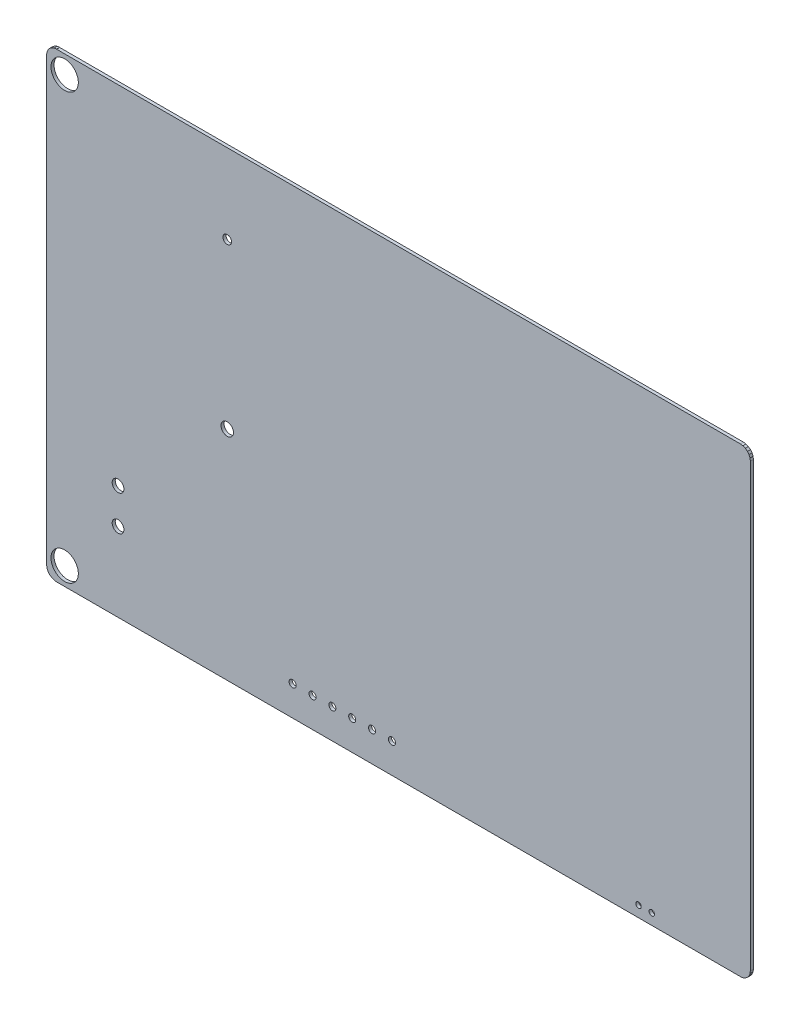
ISO-10303-21;
HEADER;
FILE_DESCRIPTION(('STEP AP214'),'2;1');
FILE_NAME('part.step','',(''),(''),'','','');
FILE_SCHEMA(('AUTOMOTIVE_DESIGN { 1 0 10303 214 1 1 1 1 }'));
ENDSEC;
DATA;
#1=APPLICATION_CONTEXT('core data for automotive mechanical design processes');
#2=APPLICATION_PROTOCOL_DEFINITION('international standard','automotive_design',2000,#1);
#3=PRODUCT_CONTEXT('',#1,'mechanical');
#4=PRODUCT('Part','Part','',(#3));
#5=PRODUCT_RELATED_PRODUCT_CATEGORY('part','',(#4));
#6=PRODUCT_DEFINITION_FORMATION('','',#4);
#7=PRODUCT_DEFINITION_CONTEXT('part definition',#1,'design');
#8=PRODUCT_DEFINITION('design','',#6,#7);
#9=PRODUCT_DEFINITION_SHAPE('','',#8);
#10=(LENGTH_UNIT() NAMED_UNIT(*) SI_UNIT(.MILLI.,.METRE.));
#11=(NAMED_UNIT(*) PLANE_ANGLE_UNIT() SI_UNIT($,.RADIAN.));
#12=(NAMED_UNIT(*) SI_UNIT($,.STERADIAN.) SOLID_ANGLE_UNIT());
#13=UNCERTAINTY_MEASURE_WITH_UNIT(LENGTH_MEASURE(1.E-05),#10,'distance_accuracy_value','');
#14=(GEOMETRIC_REPRESENTATION_CONTEXT(3) GLOBAL_UNCERTAINTY_ASSIGNED_CONTEXT((#13)) GLOBAL_UNIT_ASSIGNED_CONTEXT((#10,
#11,#12)) REPRESENTATION_CONTEXT('',''));
#15=CARTESIAN_POINT('',(0.,0.,0.));
#16=DIRECTION('',(0.,0.,1.));
#17=DIRECTION('',(1.,0.,0.));
#18=AXIS2_PLACEMENT_3D('',#15,#16,#17);
#19=CARTESIAN_POINT('',(-0.01095756,1.27,0.));
#20=DIRECTION('',(0.,0.,-1.));
#21=DIRECTION('',(-1.,0.,0.));
#22=AXIS2_PLACEMENT_3D('',#19,#20,#21);
#23=PLANE('',#22);
#24=CARTESIAN_POINT('',(41.62300032,3.81,0.));
#25=DIRECTION('',(0.,0.,-1.));
#26=DIRECTION('',(-1.,0.,0.));
#27=AXIS2_PLACEMENT_3D('',#24,#25,#26);
#28=CIRCLE('',#27,0.4499991);
#29=CARTESIAN_POINT('',(41.17300122,3.81,0.));
#30=VERTEX_POINT('',#29);
#31=EDGE_CURVE('E287',#30,#30,#28,.F.);
#32=ORIENTED_EDGE('',*,*,#31,.T.);
#33=EDGE_LOOP('',(#32));
#34=FACE_BOUND('',#33,.T.);
#35=CARTESIAN_POINT('',(44.16300032,3.81,0.));
#36=DIRECTION('',(0.,0.,-1.));
#37=DIRECTION('',(-1.,0.,0.));
#38=AXIS2_PLACEMENT_3D('',#35,#36,#37);
#39=CIRCLE('',#38,0.4499991);
#40=CARTESIAN_POINT('',(43.71300122,3.81,0.));
#41=VERTEX_POINT('',#40);
#42=EDGE_CURVE('E290',#41,#41,#39,.F.);
#43=ORIENTED_EDGE('',*,*,#42,.T.);
#44=EDGE_LOOP('',(#43));
#45=FACE_BOUND('',#44,.T.);
#46=CARTESIAN_POINT('',(36.54300032,3.81,0.));
#47=DIRECTION('',(0.,0.,-1.));
#48=DIRECTION('',(-1.,0.,0.));
#49=AXIS2_PLACEMENT_3D('',#46,#47,#48);
#50=CIRCLE('',#49,0.4499991);
#51=CARTESIAN_POINT('',(36.09300122,3.81,0.));
#52=VERTEX_POINT('',#51);
#53=EDGE_CURVE('E293',#52,#52,#50,.F.);
#54=ORIENTED_EDGE('',*,*,#53,.T.);
#55=EDGE_LOOP('',(#54));
#56=FACE_BOUND('',#55,.T.);
#57=CARTESIAN_POINT('',(39.08300032,3.81,0.));
#58=DIRECTION('',(0.,0.,-1.));
#59=DIRECTION('',(-1.,0.,0.));
#60=AXIS2_PLACEMENT_3D('',#57,#58,#59);
#61=CIRCLE('',#60,0.4499991);
#62=CARTESIAN_POINT('',(38.63300122,3.81,0.));
#63=VERTEX_POINT('',#62);
#64=EDGE_CURVE('E296',#63,#63,#61,.F.);
#65=ORIENTED_EDGE('',*,*,#64,.T.);
#66=EDGE_LOOP('',(#65));
#67=FACE_BOUND('',#66,.T.);
#68=CARTESIAN_POINT('',(75.70559916,1.397,0.));
#69=DIRECTION('',(0.,0.,-1.));
#70=DIRECTION('',(-1.,0.,0.));
#71=AXIS2_PLACEMENT_3D('',#68,#69,#70);
#72=CIRCLE('',#71,0.3499993);
#73=CARTESIAN_POINT('',(75.35559986,1.397,0.));
#74=VERTEX_POINT('',#73);
#75=EDGE_CURVE('E299',#74,#74,#72,.F.);
#76=ORIENTED_EDGE('',*,*,#75,.T.);
#77=EDGE_LOOP('',(#76));
#78=FACE_BOUND('',#77,.T.);
#79=CARTESIAN_POINT('',(77.40560084,1.397,0.));
#80=DIRECTION('',(0.,0.,-1.));
#81=DIRECTION('',(-1.,0.,0.));
#82=AXIS2_PLACEMENT_3D('',#79,#80,#81);
#83=CIRCLE('',#82,0.3499993);
#84=CARTESIAN_POINT('',(77.05560154,1.397,0.));
#85=VERTEX_POINT('',#84);
#86=EDGE_CURVE('E302',#85,#85,#83,.F.);
#87=ORIENTED_EDGE('',*,*,#86,.T.);
#88=EDGE_LOOP('',(#87));
#89=FACE_BOUND('',#88,.T.);
#90=CARTESIAN_POINT('',(34.00300032,3.7846,0.));
#91=DIRECTION('',(0.,0.,-1.));
#92=DIRECTION('',(-1.,0.,0.));
#93=AXIS2_PLACEMENT_3D('',#90,#91,#92);
#94=CIRCLE('',#93,0.4499991);
#95=CARTESIAN_POINT('',(33.55300122,3.7846,0.));
#96=VERTEX_POINT('',#95);
#97=EDGE_CURVE('E305',#96,#96,#94,.F.);
#98=ORIENTED_EDGE('',*,*,#97,.T.);
#99=EDGE_LOOP('',(#98));
#100=FACE_BOUND('',#99,.T.);
#101=CARTESIAN_POINT('',(23.09339552,48.8339892,0.));
#102=DIRECTION('',(0.,0.,-1.));
#103=DIRECTION('',(-1.,0.,0.));
#104=AXIS2_PLACEMENT_3D('',#101,#102,#103);
#105=CIRCLE('',#104,0.5499989);
#106=CARTESIAN_POINT('',(22.54339662,48.8339892,0.));
#107=VERTEX_POINT('',#106);
#108=EDGE_CURVE('E308',#107,#107,#105,.F.);
#109=ORIENTED_EDGE('',*,*,#108,.T.);
#110=EDGE_LOOP('',(#109));
#111=FACE_BOUND('',#110,.T.);
#112=CARTESIAN_POINT('',(23.09339552,27.8340058,0.));
#113=DIRECTION('',(0.,0.,-1.));
#114=DIRECTION('',(-1.,0.,0.));
#115=AXIS2_PLACEMENT_3D('',#112,#113,#114);
#116=CIRCLE('',#115,0.7999984);
#117=CARTESIAN_POINT('',(22.29339712,27.8340058,0.));
#118=VERTEX_POINT('',#117);
#119=EDGE_CURVE('E311',#118,#118,#116,.F.);
#120=ORIENTED_EDGE('',*,*,#119,.T.);
#121=EDGE_LOOP('',(#120));
#122=FACE_BOUND('',#121,.T.);
#123=CARTESIAN_POINT('',(2.30000048,56.7000009,0.));
#124=DIRECTION('',(0.,0.,-1.));
#125=DIRECTION('',(-1.,0.,0.));
#126=AXIS2_PLACEMENT_3D('',#123,#124,#125);
#127=CIRCLE('',#126,1.74999904);
#128=CARTESIAN_POINT('',(0.55000144,56.7000009,0.));
#129=VERTEX_POINT('',#128);
#130=EDGE_CURVE('E314',#129,#129,#127,.F.);
#131=ORIENTED_EDGE('',*,*,#130,.T.);
#132=EDGE_LOOP('',(#131));
#133=FACE_BOUND('',#132,.T.);
#134=CARTESIAN_POINT('',(9.12910036,14.56899804,0.));
#135=DIRECTION('',(0.,0.,-1.));
#136=DIRECTION('',(-1.,0.,0.));
#137=AXIS2_PLACEMENT_3D('',#134,#135,#136);
#138=CIRCLE('',#137,0.7499985);
#139=CARTESIAN_POINT('',(8.37910186,14.56899804,0.));
#140=VERTEX_POINT('',#139);
#141=EDGE_CURVE('E317',#140,#140,#138,.F.);
#142=ORIENTED_EDGE('',*,*,#141,.T.);
#143=EDGE_LOOP('',(#142));
#144=FACE_BOUND('',#143,.T.);
#145=CARTESIAN_POINT('',(9.12910036,10.06899688,0.));
#146=DIRECTION('',(0.,0.,-1.));
#147=DIRECTION('',(-1.,0.,0.));
#148=AXIS2_PLACEMENT_3D('',#145,#146,#147);
#149=CIRCLE('',#148,0.7499985);
#150=CARTESIAN_POINT('',(8.37910186,10.06899688,0.));
#151=VERTEX_POINT('',#150);
#152=EDGE_CURVE('E320',#151,#151,#149,.F.);
#153=ORIENTED_EDGE('',*,*,#152,.T.);
#154=EDGE_LOOP('',(#153));
#155=FACE_BOUND('',#154,.T.);
#156=CARTESIAN_POINT('',(31.46300032,3.81,0.));
#157=DIRECTION('',(0.,0.,-1.));
#158=DIRECTION('',(-1.,0.,0.));
#159=AXIS2_PLACEMENT_3D('',#156,#157,#158);
#160=CIRCLE('',#159,0.4499991);
#161=CARTESIAN_POINT('',(31.01300122,3.81,0.));
#162=VERTEX_POINT('',#161);
#163=EDGE_CURVE('E322',#162,#162,#160,.F.);
#164=ORIENTED_EDGE('',*,*,#163,.T.);
#165=EDGE_LOOP('',(#164));
#166=FACE_BOUND('',#165,.T.);
#167=CARTESIAN_POINT('',(2.30000048,2.30000048,0.));
#168=DIRECTION('',(0.,0.,-1.));
#169=DIRECTION('',(-1.,0.,0.));
#170=AXIS2_PLACEMENT_3D('',#167,#168,#169);
#171=CIRCLE('',#170,1.74999904);
#172=CARTESIAN_POINT('',(0.55000144,2.30000048,0.));
#173=VERTEX_POINT('',#172);
#174=EDGE_CURVE('E20',#173,#173,#171,.F.);
#175=ORIENTED_EDGE('',*,*,#174,.T.);
#176=EDGE_LOOP('',(#175));
#177=FACE_BOUND('',#176,.T.);
#178=DIRECTION('',(-0.382682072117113,0.923880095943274,0.));
#179=VECTOR('',#178,1.);
#180=CARTESIAN_POINT('',(0.0326898,0.93846396,0.));
#181=LINE('',#180,#179);
#182=CARTESIAN_POINT('',(0.160657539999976,0.62952121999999,0.));
#183=VERTEX_POINT('',#182);
#184=CARTESIAN_POINT('',(0.032689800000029,0.938463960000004,0.));
#185=VERTEX_POINT('',#184);
#186=EDGE_CURVE('E336',#183,#185,#181,.T.);
#187=ORIENTED_EDGE('',*,*,#186,.T.);
#188=DIRECTION('',(-0.13052564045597,0.991444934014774,0.));
#189=VECTOR('',#188,1.);
#190=CARTESIAN_POINT('',(-0.01095756,1.27,0.));
#191=LINE('',#190,#189);
#192=CARTESIAN_POINT('',(-0.01095756,1.27,0.));
#193=VERTEX_POINT('',#192);
#194=EDGE_CURVE('E228',#185,#193,#191,.T.);
#195=ORIENTED_EDGE('',*,*,#194,.T.);
#196=DIRECTION('',(1.,0.,0.));
#197=VECTOR('',#196,1.);
#198=CARTESIAN_POINT('',(0.,1.27,0.));
#199=LINE('',#198,#197);
#200=CARTESIAN_POINT('',(0.,1.27,0.));
#201=VERTEX_POINT('',#200);
#202=EDGE_CURVE('E227',#193,#201,#199,.T.);
#203=ORIENTED_EDGE('',*,*,#202,.T.);
#204=DIRECTION('',(-0.00019407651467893,0.999999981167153,0.));
#205=VECTOR('',#204,1.);
#206=CARTESIAN_POINT('',(-0.01095756,57.72999884,0.));
#207=LINE('',#206,#205);
#208=CARTESIAN_POINT('',(-0.0109575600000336,57.7299988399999,0.));
#209=VERTEX_POINT('',#208);
#210=EDGE_CURVE('E224',#201,#209,#207,.T.);
#211=ORIENTED_EDGE('',*,*,#210,.T.);
#212=DIRECTION('',(0.13052564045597,0.991444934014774,0.));
#213=VECTOR('',#212,1.);
#214=CARTESIAN_POINT('',(0.0326898,58.06153488,0.));
#215=LINE('',#214,#213);
#216=CARTESIAN_POINT('',(0.0326898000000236,58.06153488,0.));
#217=VERTEX_POINT('',#216);
#218=EDGE_CURVE('E476',#209,#217,#215,.T.);
#219=ORIENTED_EDGE('',*,*,#218,.T.);
#220=DIRECTION('',(0.382682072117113,0.923880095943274,0.));
#221=VECTOR('',#220,1.);
#222=CARTESIAN_POINT('',(0.16065754,58.37047762,0.));
#223=LINE('',#222,#221);
#224=CARTESIAN_POINT('',(0.16065754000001,58.37047762,0.));
#225=VERTEX_POINT('',#224);
#226=EDGE_CURVE('E471',#217,#225,#223,.T.);
#227=ORIENTED_EDGE('',*,*,#226,.T.);
#228=DIRECTION('',(0.608761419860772,0.793353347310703,0.));
#229=VECTOR('',#228,1.);
#230=CARTESIAN_POINT('',(0.36422584,58.635773,0.));
#231=LINE('',#230,#229);
#232=CARTESIAN_POINT('',(0.364225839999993,58.635773,0.));
#233=VERTEX_POINT('',#232);
#234=EDGE_CURVE('E466',#225,#233,#231,.T.);
#235=ORIENTED_EDGE('',*,*,#234,.T.);
#236=DIRECTION('',(0.793353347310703,0.608761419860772,0.));
#237=VECTOR('',#236,1.);
#238=CARTESIAN_POINT('',(0.62952122,58.8393413,0.));
#239=LINE('',#238,#237);
#240=CARTESIAN_POINT('',(0.62952121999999,58.8393413,0.));
#241=VERTEX_POINT('',#240);
#242=EDGE_CURVE('E461',#233,#241,#239,.T.);
#243=ORIENTED_EDGE('',*,*,#242,.T.);
#244=DIRECTION('',(0.923880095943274,0.382682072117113,0.));
#245=VECTOR('',#244,1.);
#246=CARTESIAN_POINT('',(0.93846396,58.96730904,0.));
#247=LINE('',#246,#245);
#248=CARTESIAN_POINT('',(0.938463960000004,58.96730904,0.));
#249=VERTEX_POINT('',#248);
#250=EDGE_CURVE('E456',#241,#249,#247,.T.);
#251=ORIENTED_EDGE('',*,*,#250,.T.);
#252=DIRECTION('',(0.991444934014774,0.13052564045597,0.));
#253=VECTOR('',#252,1.);
#254=CARTESIAN_POINT('',(1.27,59.0109564,0.));
#255=LINE('',#254,#253);
#256=CARTESIAN_POINT('',(1.27,59.0109564,0.));
#257=VERTEX_POINT('',#256);
#258=EDGE_CURVE('E451',#249,#257,#255,.T.);
#259=ORIENTED_EDGE('',*,*,#258,.T.);
#260=DIRECTION('',(0.,1.,0.));
#261=VECTOR('',#260,1.);
#262=CARTESIAN_POINT('',(1.27,58.99999884,0.));
#263=LINE('',#262,#261);
#264=CARTESIAN_POINT('',(1.26999999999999,58.99999884,0.));
#265=VERTEX_POINT('',#264);
#266=EDGE_CURVE('E446',#257,#265,#263,.F.);
#267=ORIENTED_EDGE('',*,*,#266,.T.);
#268=DIRECTION('',(0.999999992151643,0.000125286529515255,0.));
#269=VECTOR('',#268,1.);
#270=CARTESIAN_POINT('',(88.73000034,59.0109564,0.));
#271=LINE('',#270,#269);
#272=CARTESIAN_POINT('',(88.7300003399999,59.0109564,0.));
#273=VERTEX_POINT('',#272);
#274=EDGE_CURVE('E441',#265,#273,#271,.T.);
#275=ORIENTED_EDGE('',*,*,#274,.T.);
#276=DIRECTION('',(0.991444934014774,-0.13052564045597,0.));
#277=VECTOR('',#276,1.);
#278=CARTESIAN_POINT('',(89.06153638,58.96730904,0.));
#279=LINE('',#278,#277);
#280=CARTESIAN_POINT('',(89.06153638,58.96730904,0.));
#281=VERTEX_POINT('',#280);
#282=EDGE_CURVE('E436',#273,#281,#279,.T.);
#283=ORIENTED_EDGE('',*,*,#282,.T.);
#284=DIRECTION('',(0.923880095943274,-0.382682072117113,0.));
#285=VECTOR('',#284,1.);
#286=CARTESIAN_POINT('',(89.37047912,58.8393413,0.));
#287=LINE('',#286,#285);
#288=CARTESIAN_POINT('',(89.37047912,58.8393413,0.));
#289=VERTEX_POINT('',#288);
#290=EDGE_CURVE('E431',#281,#289,#287,.T.);
#291=ORIENTED_EDGE('',*,*,#290,.T.);
#292=DIRECTION('',(0.793353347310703,-0.608761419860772,0.));
#293=VECTOR('',#292,1.);
#294=CARTESIAN_POINT('',(89.6357745,58.635773,0.));
#295=LINE('',#294,#293);
#296=CARTESIAN_POINT('',(89.6357745,58.635773,0.));
#297=VERTEX_POINT('',#296);
#298=EDGE_CURVE('E426',#289,#297,#295,.T.);
#299=ORIENTED_EDGE('',*,*,#298,.T.);
#300=DIRECTION('',(0.608761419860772,-0.793353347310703,0.));
#301=VECTOR('',#300,1.);
#302=CARTESIAN_POINT('',(89.8393428,58.37047762,0.));
#303=LINE('',#302,#301);
#304=CARTESIAN_POINT('',(89.8393428,58.37047762,0.));
#305=VERTEX_POINT('',#304);
#306=EDGE_CURVE('E421',#297,#305,#303,.T.);
#307=ORIENTED_EDGE('',*,*,#306,.T.);
#308=DIRECTION('',(0.382682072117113,-0.923880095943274,0.));
#309=VECTOR('',#308,1.);
#310=CARTESIAN_POINT('',(89.96731054,58.06153488,0.));
#311=LINE('',#310,#309);
#312=CARTESIAN_POINT('',(89.96731054,58.06153488,0.));
#313=VERTEX_POINT('',#312);
#314=EDGE_CURVE('E416',#305,#313,#311,.T.);
#315=ORIENTED_EDGE('',*,*,#314,.T.);
#316=DIRECTION('',(0.13052564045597,-0.991444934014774,0.));
#317=VECTOR('',#316,1.);
#318=CARTESIAN_POINT('',(90.0109579,57.72999884,0.));
#319=LINE('',#318,#317);
#320=CARTESIAN_POINT('',(90.0109579,57.72999884,0.));
#321=VERTEX_POINT('',#320);
#322=EDGE_CURVE('E411',#313,#321,#319,.T.);
#323=ORIENTED_EDGE('',*,*,#322,.T.);
#324=DIRECTION('',(1.,0.,0.));
#325=VECTOR('',#324,1.);
#326=CARTESIAN_POINT('',(90.00000034,57.72999884,0.));
#327=LINE('',#326,#325);
#328=CARTESIAN_POINT('',(90.00000034,57.72999884,0.));
#329=VERTEX_POINT('',#328);
#330=EDGE_CURVE('E406',#321,#329,#327,.F.);
#331=ORIENTED_EDGE('',*,*,#330,.T.);
#332=DIRECTION('',(0.00019407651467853,-0.999999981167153,0.));
#333=VECTOR('',#332,1.);
#334=CARTESIAN_POINT('',(90.0109579,1.27,0.));
#335=LINE('',#334,#333);
#336=CARTESIAN_POINT('',(90.0109579,1.27000000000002,0.));
#337=VERTEX_POINT('',#336);
#338=EDGE_CURVE('E401',#329,#337,#335,.T.);
#339=ORIENTED_EDGE('',*,*,#338,.T.);
#340=DIRECTION('',(-0.13052564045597,-0.991444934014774,0.));
#341=VECTOR('',#340,1.);
#342=CARTESIAN_POINT('',(89.96731054,0.93846396,0.));
#343=LINE('',#342,#341);
#344=CARTESIAN_POINT('',(89.96731054,0.93846396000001,0.));
#345=VERTEX_POINT('',#344);
#346=EDGE_CURVE('E396',#337,#345,#343,.T.);
#347=ORIENTED_EDGE('',*,*,#346,.T.);
#348=DIRECTION('',(-0.382682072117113,-0.923880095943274,0.));
#349=VECTOR('',#348,1.);
#350=CARTESIAN_POINT('',(89.8393428,0.62952122,0.));
#351=LINE('',#350,#349);
#352=CARTESIAN_POINT('',(89.8393428,0.629521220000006,0.));
#353=VERTEX_POINT('',#352);
#354=EDGE_CURVE('E391',#345,#353,#351,.T.);
#355=ORIENTED_EDGE('',*,*,#354,.T.);
#356=DIRECTION('',(-0.608761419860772,-0.793353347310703,0.));
#357=VECTOR('',#356,1.);
#358=CARTESIAN_POINT('',(89.6357745,0.36422584,0.));
#359=LINE('',#358,#357);
#360=CARTESIAN_POINT('',(89.6357745,0.364225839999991,0.));
#361=VERTEX_POINT('',#360);
#362=EDGE_CURVE('E386',#353,#361,#359,.T.);
#363=ORIENTED_EDGE('',*,*,#362,.T.);
#364=DIRECTION('',(-0.793353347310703,-0.608761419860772,0.));
#365=VECTOR('',#364,1.);
#366=CARTESIAN_POINT('',(89.37047912,0.16065754,0.));
#367=LINE('',#366,#365);
#368=CARTESIAN_POINT('',(89.37047912,0.160657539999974,0.));
#369=VERTEX_POINT('',#368);
#370=EDGE_CURVE('E381',#361,#369,#367,.T.);
#371=ORIENTED_EDGE('',*,*,#370,.T.);
#372=DIRECTION('',(-0.923880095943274,-0.382682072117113,0.));
#373=VECTOR('',#372,1.);
#374=CARTESIAN_POINT('',(89.06153638,0.0326898,0.));
#375=LINE('',#374,#373);
#376=CARTESIAN_POINT('',(89.06153638,0.0326898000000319,0.));
#377=VERTEX_POINT('',#376);
#378=EDGE_CURVE('E376',#369,#377,#375,.T.);
#379=ORIENTED_EDGE('',*,*,#378,.T.);
#380=DIRECTION('',(-0.991444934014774,-0.13052564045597,0.));
#381=VECTOR('',#380,1.);
#382=CARTESIAN_POINT('',(88.73000034,-0.01095755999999,0.));
#383=LINE('',#382,#381);
#384=CARTESIAN_POINT('',(88.73000034,-0.01095755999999,0.));
#385=VERTEX_POINT('',#384);
#386=EDGE_CURVE('E371',#377,#385,#383,.T.);
#387=ORIENTED_EDGE('',*,*,#386,.T.);
#388=DIRECTION('',(0.,1.,0.));
#389=VECTOR('',#388,1.);
#390=CARTESIAN_POINT('',(88.73000034,0.,0.));
#391=LINE('',#390,#389);
#392=CARTESIAN_POINT('',(88.73000034,0.,0.));
#393=VERTEX_POINT('',#392);
#394=EDGE_CURVE('E366',#385,#393,#391,.T.);
#395=ORIENTED_EDGE('',*,*,#394,.T.);
#396=DIRECTION('',(-0.999999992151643,-0.000125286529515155,0.));
#397=VECTOR('',#396,1.);
#398=CARTESIAN_POINT('',(1.27,-0.01095755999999,0.));
#399=LINE('',#398,#397);
#400=CARTESIAN_POINT('',(1.2699999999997,-0.0109575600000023,0.));
#401=VERTEX_POINT('',#400);
#402=EDGE_CURVE('E361',#393,#401,#399,.T.);
#403=ORIENTED_EDGE('',*,*,#402,.T.);
#404=DIRECTION('',(-0.991444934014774,0.13052564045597,0.));
#405=VECTOR('',#404,1.);
#406=CARTESIAN_POINT('',(0.93846396,0.0326898,0.));
#407=LINE('',#406,#405);
#408=CARTESIAN_POINT('',(0.93846396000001,0.0326898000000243,0.));
#409=VERTEX_POINT('',#408);
#410=EDGE_CURVE('E356',#401,#409,#407,.T.);
#411=ORIENTED_EDGE('',*,*,#410,.T.);
#412=DIRECTION('',(-0.923880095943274,0.382682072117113,0.));
#413=VECTOR('',#412,1.);
#414=CARTESIAN_POINT('',(0.62952122,0.16065754,0.));
#415=LINE('',#414,#413);
#416=CARTESIAN_POINT('',(0.629521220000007,0.160657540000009,0.));
#417=VERTEX_POINT('',#416);
#418=EDGE_CURVE('E351',#409,#417,#415,.T.);
#419=ORIENTED_EDGE('',*,*,#418,.T.);
#420=DIRECTION('',(-0.793353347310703,0.608761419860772,0.));
#421=VECTOR('',#420,1.);
#422=CARTESIAN_POINT('',(0.36422584,0.36422584,0.));
#423=LINE('',#422,#421);
#424=CARTESIAN_POINT('',(0.364225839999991,0.364225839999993,0.));
#425=VERTEX_POINT('',#424);
#426=EDGE_CURVE('E346',#417,#425,#423,.T.);
#427=ORIENTED_EDGE('',*,*,#426,.T.);
#428=DIRECTION('',(-0.608761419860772,0.793353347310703,0.));
#429=VECTOR('',#428,1.);
#430=CARTESIAN_POINT('',(0.16065754,0.62952122,0.));
#431=LINE('',#430,#429);
#432=EDGE_CURVE('E341',#425,#183,#431,.T.);
#433=ORIENTED_EDGE('',*,*,#432,.T.);
#434=EDGE_LOOP('',(#187,#195,#203,#211,#219,#227,#235,#243,#251,#259,#267,#275,#283,#291,#299,
#307,#315,#323,#331,#339,#347,#355,#363,#371,#379,#387,#395,#403,#411,#419,#427,#433));
#435=FACE_BOUND('',#434,.T.);
#436=ADVANCED_FACE('F17',(#34,#45,#56,#67,#78,#89,#100,#111,#122,#133,#144,#155,#166,#177,#435),
#23,.T.);
#437=CARTESIAN_POINT('',(0.,1.27,0.));
#438=DIRECTION('',(0.,-1.,0.));
#439=DIRECTION('',(0.,0.,-1.));
#440=AXIS2_PLACEMENT_3D('',#437,#438,#439);
#441=PLANE('',#440);
#442=DIRECTION('',(0.,0.,1.));
#443=VECTOR('',#442,1.);
#444=CARTESIAN_POINT('',(-0.01095756,1.27,0.));
#445=LINE('',#444,#443);
#446=CARTESIAN_POINT('',(-0.01095756,1.27,0.39116));
#447=VERTEX_POINT('',#446);
#448=EDGE_CURVE('E330',#193,#447,#445,.T.);
#449=ORIENTED_EDGE('',*,*,#448,.T.);
#450=DIRECTION('',(-1.,0.,0.));
#451=VECTOR('',#450,1.);
#452=CARTESIAN_POINT('',(-0.01095756,1.27,0.39116));
#453=LINE('',#452,#451);
#454=CARTESIAN_POINT('',(0.,1.27,0.39116));
#455=VERTEX_POINT('',#454);
#456=EDGE_CURVE('E244',#447,#455,#453,.F.);
#457=ORIENTED_EDGE('',*,*,#456,.T.);
#458=DIRECTION('',(0.,0.,1.));
#459=VECTOR('',#458,1.);
#460=CARTESIAN_POINT('',(0.,1.27,0.));
#461=LINE('',#460,#459);
#462=EDGE_CURVE('E233',#455,#201,#461,.F.);
#463=ORIENTED_EDGE('',*,*,#462,.T.);
#464=ORIENTED_EDGE('',*,*,#202,.F.);
#465=EDGE_LOOP('',(#449,#457,#463,#464));
#466=FACE_BOUND('',#465,.T.);
#467=ADVANCED_FACE('F243',(#466),#441,.F.);
#468=CARTESIAN_POINT('',(-0.01095756,57.72999884,0.));
#469=DIRECTION('',(0.999999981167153,0.00019407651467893,0.));
#470=DIRECTION('',(-0.00019407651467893,0.999999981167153,0.));
#471=AXIS2_PLACEMENT_3D('',#468,#469,#470);
#472=PLANE('',#471);
#473=ORIENTED_EDGE('',*,*,#462,.F.);
#474=DIRECTION('',(-0.000194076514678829,0.999999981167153,0.));
#475=VECTOR('',#474,1.);
#476=CARTESIAN_POINT('',(0.,1.27,0.39116));
#477=LINE('',#476,#475);
#478=CARTESIAN_POINT('',(-0.0109575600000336,57.7299988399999,0.39116));
#479=VERTEX_POINT('',#478);
#480=EDGE_CURVE('E490',#455,#479,#477,.T.);
#481=ORIENTED_EDGE('',*,*,#480,.T.);
#482=DIRECTION('',(0.,0.,1.));
#483=VECTOR('',#482,1.);
#484=CARTESIAN_POINT('',(-0.0109575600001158,57.72999884,0.));
#485=LINE('',#484,#483);
#486=EDGE_CURVE('E240',#479,#209,#485,.F.);
#487=ORIENTED_EDGE('',*,*,#486,.T.);
#488=ORIENTED_EDGE('',*,*,#210,.F.);
#489=EDGE_LOOP('',(#473,#481,#487,#488));
#490=FACE_BOUND('',#489,.T.);
#491=ADVANCED_FACE('F237',(#490),#472,.F.);
#492=CARTESIAN_POINT('',(0.0326898,58.06153488,0.));
#493=DIRECTION('',(0.991444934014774,-0.13052564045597,0.));
#494=DIRECTION('',(0.13052564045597,0.991444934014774,0.));
#495=AXIS2_PLACEMENT_3D('',#492,#493,#494);
#496=PLANE('',#495);
#497=ORIENTED_EDGE('',*,*,#486,.F.);
#498=DIRECTION('',(0.130525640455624,0.991444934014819,0.));
#499=VECTOR('',#498,1.);
#500=CARTESIAN_POINT('',(-0.01095756,57.72999884,0.39116));
#501=LINE('',#500,#499);
#502=CARTESIAN_POINT('',(0.0326898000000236,58.06153488,0.39116));
#503=VERTEX_POINT('',#502);
#504=EDGE_CURVE('E487',#479,#503,#501,.T.);
#505=ORIENTED_EDGE('',*,*,#504,.T.);
#506=DIRECTION('',(0.,0.,1.));
#507=VECTOR('',#506,1.);
#508=CARTESIAN_POINT('',(0.0326898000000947,58.06153488,0.));
#509=LINE('',#508,#507);
#510=EDGE_CURVE('E473',#503,#217,#509,.F.);
#511=ORIENTED_EDGE('',*,*,#510,.T.);
#512=ORIENTED_EDGE('',*,*,#218,.F.);
#513=EDGE_LOOP('',(#497,#505,#511,#512));
#514=FACE_BOUND('',#513,.T.);
#515=ADVANCED_FACE('F485',(#514),#496,.F.);
#516=CARTESIAN_POINT('',(0.16065754,58.37047762,0.));
#517=DIRECTION('',(0.923880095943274,-0.382682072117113,0.));
#518=DIRECTION('',(0.382682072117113,0.923880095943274,0.));
#519=AXIS2_PLACEMENT_3D('',#516,#517,#518);
#520=PLANE('',#519);
#521=ORIENTED_EDGE('',*,*,#510,.F.);
#522=DIRECTION('',(0.382682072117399,0.923880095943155,0.));
#523=VECTOR('',#522,1.);
#524=CARTESIAN_POINT('',(0.0326898,58.06153488,0.39116));
#525=LINE('',#524,#523);
#526=CARTESIAN_POINT('',(0.16065754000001,58.37047762,0.39116));
#527=VERTEX_POINT('',#526);
#528=EDGE_CURVE('E489',#503,#527,#525,.T.);
#529=ORIENTED_EDGE('',*,*,#528,.T.);
#530=DIRECTION('',(0.,0.,1.));
#531=VECTOR('',#530,1.);
#532=CARTESIAN_POINT('',(0.16065754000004,58.37047762,0.));
#533=LINE('',#532,#531);
#534=EDGE_CURVE('E468',#527,#225,#533,.F.);
#535=ORIENTED_EDGE('',*,*,#534,.T.);
#536=ORIENTED_EDGE('',*,*,#226,.F.);
#537=EDGE_LOOP('',(#521,#529,#535,#536));
#538=FACE_BOUND('',#537,.T.);
#539=ADVANCED_FACE('F481',(#538),#520,.F.);
#540=CARTESIAN_POINT('',(0.36422584,58.635773,0.));
#541=DIRECTION('',(0.793353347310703,-0.608761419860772,0.));
#542=DIRECTION('',(0.608761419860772,0.793353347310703,0.));
#543=AXIS2_PLACEMENT_3D('',#540,#541,#542);
#544=PLANE('',#543);
#545=ORIENTED_EDGE('',*,*,#534,.F.);
#546=DIRECTION('',(0.608761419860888,0.793353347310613,0.));
#547=VECTOR('',#546,1.);
#548=CARTESIAN_POINT('',(0.16065754,58.37047762,0.39116));
#549=LINE('',#548,#547);
#550=CARTESIAN_POINT('',(0.364225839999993,58.635773,0.39116));
#551=VERTEX_POINT('',#550);
#552=EDGE_CURVE('E492',#527,#551,#549,.T.);
#553=ORIENTED_EDGE('',*,*,#552,.T.);
#554=DIRECTION('',(0.,0.,1.));
#555=VECTOR('',#554,1.);
#556=CARTESIAN_POINT('',(0.364225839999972,58.635773,0.));
#557=LINE('',#556,#555);
#558=EDGE_CURVE('E463',#551,#233,#557,.F.);
#559=ORIENTED_EDGE('',*,*,#558,.T.);
#560=ORIENTED_EDGE('',*,*,#234,.F.);
#561=EDGE_LOOP('',(#545,#553,#559,#560));
#562=FACE_BOUND('',#561,.T.);
#563=ADVANCED_FACE('F683',(#562),#544,.F.);
#564=CARTESIAN_POINT('',(0.62952122,58.8393413,0.));
#565=DIRECTION('',(0.608761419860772,-0.793353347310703,0.));
#566=DIRECTION('',(0.793353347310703,0.608761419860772,0.));
#567=AXIS2_PLACEMENT_3D('',#564,#565,#566);
#568=PLANE('',#567);
#569=ORIENTED_EDGE('',*,*,#558,.F.);
#570=DIRECTION('',(0.793353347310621,0.608761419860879,0.));
#571=VECTOR('',#570,1.);
#572=CARTESIAN_POINT('',(0.36422584,58.635773,0.39116));
#573=LINE('',#572,#571);
#574=CARTESIAN_POINT('',(0.62952121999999,58.8393413,0.39116));
#575=VERTEX_POINT('',#574);
#576=EDGE_CURVE('E497',#551,#575,#573,.T.);
#577=ORIENTED_EDGE('',*,*,#576,.T.);
#578=DIRECTION('',(0.,0.,1.));
#579=VECTOR('',#578,1.);
#580=CARTESIAN_POINT('',(0.629521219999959,58.8393413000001,0.));
#581=LINE('',#580,#579);
#582=EDGE_CURVE('E458',#575,#241,#581,.F.);
#583=ORIENTED_EDGE('',*,*,#582,.T.);
#584=ORIENTED_EDGE('',*,*,#242,.F.);
#585=EDGE_LOOP('',(#569,#577,#583,#584));
#586=FACE_BOUND('',#585,.T.);
#587=ADVANCED_FACE('F680',(#586),#568,.F.);
#588=CARTESIAN_POINT('',(0.93846396,58.96730904,0.));
#589=DIRECTION('',(0.382682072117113,-0.923880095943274,0.));
#590=DIRECTION('',(0.923880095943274,0.382682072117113,0.));
#591=AXIS2_PLACEMENT_3D('',#588,#589,#590);
#592=PLANE('',#591);
#593=ORIENTED_EDGE('',*,*,#582,.F.);
#594=DIRECTION('',(0.923880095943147,0.382682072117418,0.));
#595=VECTOR('',#594,1.);
#596=CARTESIAN_POINT('',(0.62952122,58.8393413,0.39116));
#597=LINE('',#596,#595);
#598=CARTESIAN_POINT('',(0.938463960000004,58.96730904,0.39116));
#599=VERTEX_POINT('',#598);
#600=EDGE_CURVE('E500',#575,#599,#597,.T.);
#601=ORIENTED_EDGE('',*,*,#600,.T.);
#602=DIRECTION('',(0.,0.,1.));
#603=VECTOR('',#602,1.);
#604=CARTESIAN_POINT('',(0.938463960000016,58.9673090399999,0.));
#605=LINE('',#604,#603);
#606=EDGE_CURVE('E453',#599,#249,#605,.F.);
#607=ORIENTED_EDGE('',*,*,#606,.T.);
#608=ORIENTED_EDGE('',*,*,#250,.F.);
#609=EDGE_LOOP('',(#593,#601,#607,#608));
#610=FACE_BOUND('',#609,.T.);
#611=ADVANCED_FACE('F676',(#610),#592,.F.);
#612=CARTESIAN_POINT('',(1.27,59.0109564,0.));
#613=DIRECTION('',(0.13052564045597,-0.991444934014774,0.));
#614=DIRECTION('',(0.991444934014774,0.13052564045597,0.));
#615=AXIS2_PLACEMENT_3D('',#612,#613,#614);
#616=PLANE('',#615);
#617=ORIENTED_EDGE('',*,*,#606,.F.);
#618=DIRECTION('',(0.991444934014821,0.130525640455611,0.));
#619=VECTOR('',#618,1.);
#620=CARTESIAN_POINT('',(0.93846396,58.96730904,0.39116));
#621=LINE('',#620,#619);
#622=CARTESIAN_POINT('',(1.27,59.0109564,0.39116));
#623=VERTEX_POINT('',#622);
#624=EDGE_CURVE('E503',#599,#623,#621,.T.);
#625=ORIENTED_EDGE('',*,*,#624,.T.);
#626=DIRECTION('',(0.,0.,1.));
#627=VECTOR('',#626,1.);
#628=CARTESIAN_POINT('',(1.27,59.0109564,0.));
#629=LINE('',#628,#627);
#630=EDGE_CURVE('E448',#623,#257,#629,.F.);
#631=ORIENTED_EDGE('',*,*,#630,.T.);
#632=ORIENTED_EDGE('',*,*,#258,.F.);
#633=EDGE_LOOP('',(#617,#625,#631,#632));
#634=FACE_BOUND('',#633,.T.);
#635=ADVANCED_FACE('F672',(#634),#616,.F.);
#636=CARTESIAN_POINT('',(1.27,58.99999884,0.));
#637=DIRECTION('',(-1.,0.,0.));
#638=DIRECTION('',(0.,0.,1.));
#639=AXIS2_PLACEMENT_3D('',#636,#637,#638);
#640=PLANE('',#639);
#641=ORIENTED_EDGE('',*,*,#630,.F.);
#642=DIRECTION('',(0.,1.,0.));
#643=VECTOR('',#642,1.);
#644=CARTESIAN_POINT('',(1.27,1.27,0.39116));
#645=LINE('',#644,#643);
#646=CARTESIAN_POINT('',(1.27,58.99999884,0.39116));
#647=VERTEX_POINT('',#646);
#648=EDGE_CURVE('E506',#623,#647,#645,.F.);
#649=ORIENTED_EDGE('',*,*,#648,.T.);
#650=DIRECTION('',(0.,0.,1.));
#651=VECTOR('',#650,1.);
#652=CARTESIAN_POINT('',(1.26999999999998,58.99999884,0.));
#653=LINE('',#652,#651);
#654=EDGE_CURVE('E443',#647,#265,#653,.F.);
#655=ORIENTED_EDGE('',*,*,#654,.T.);
#656=ORIENTED_EDGE('',*,*,#266,.F.);
#657=EDGE_LOOP('',(#641,#649,#655,#656));
#658=FACE_BOUND('',#657,.T.);
#659=ADVANCED_FACE('F668',(#658),#640,.F.);
#660=CARTESIAN_POINT('',(88.73000034,59.0109564,0.));
#661=DIRECTION('',(0.000125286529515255,-0.999999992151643,0.));
#662=DIRECTION('',(0.999999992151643,0.000125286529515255,0.));
#663=AXIS2_PLACEMENT_3D('',#660,#661,#662);
#664=PLANE('',#663);
#665=ORIENTED_EDGE('',*,*,#654,.F.);
#666=DIRECTION('',(0.999999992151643,0.000125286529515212,0.));
#667=VECTOR('',#666,1.);
#668=CARTESIAN_POINT('',(1.27,58.99999884,0.39116));
#669=LINE('',#668,#667);
#670=CARTESIAN_POINT('',(88.7300003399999,59.0109564,0.39116));
#671=VERTEX_POINT('',#670);
#672=EDGE_CURVE('E509',#647,#671,#669,.T.);
#673=ORIENTED_EDGE('',*,*,#672,.T.);
#674=DIRECTION('',(0.,0.,1.));
#675=VECTOR('',#674,1.);
#676=CARTESIAN_POINT('',(88.73000034,59.0109564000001,0.));
#677=LINE('',#676,#675);
#678=EDGE_CURVE('E438',#671,#273,#677,.F.);
#679=ORIENTED_EDGE('',*,*,#678,.T.);
#680=ORIENTED_EDGE('',*,*,#274,.F.);
#681=EDGE_LOOP('',(#665,#673,#679,#680));
#682=FACE_BOUND('',#681,.T.);
#683=ADVANCED_FACE('F664',(#682),#664,.F.);
#684=CARTESIAN_POINT('',(89.06153638,58.96730904,0.));
#685=DIRECTION('',(-0.13052564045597,-0.991444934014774,0.));
#686=DIRECTION('',(0.991444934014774,-0.13052564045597,0.));
#687=AXIS2_PLACEMENT_3D('',#684,#685,#686);
#688=PLANE('',#687);
#689=ORIENTED_EDGE('',*,*,#678,.F.);
#690=DIRECTION('',(0.991444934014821,-0.130525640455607,0.));
#691=VECTOR('',#690,1.);
#692=CARTESIAN_POINT('',(88.73000034,59.0109564,0.39116));
#693=LINE('',#692,#691);
#694=CARTESIAN_POINT('',(89.06153638,58.96730904,0.39116));
#695=VERTEX_POINT('',#694);
#696=EDGE_CURVE('E512',#671,#695,#693,.T.);
#697=ORIENTED_EDGE('',*,*,#696,.T.);
#698=DIRECTION('',(0.,0.,1.));
#699=VECTOR('',#698,1.);
#700=CARTESIAN_POINT('',(89.06153638,58.9673090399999,0.));
#701=LINE('',#700,#699);
#702=EDGE_CURVE('E433',#695,#281,#701,.F.);
#703=ORIENTED_EDGE('',*,*,#702,.T.);
#704=ORIENTED_EDGE('',*,*,#282,.F.);
#705=EDGE_LOOP('',(#689,#697,#703,#704));
#706=FACE_BOUND('',#705,.T.);
#707=ADVANCED_FACE('F660',(#706),#688,.F.);
#708=CARTESIAN_POINT('',(89.37047912,58.8393413,0.));
#709=DIRECTION('',(-0.382682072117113,-0.923880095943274,0.));
#710=DIRECTION('',(0.923880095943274,-0.382682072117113,0.));
#711=AXIS2_PLACEMENT_3D('',#708,#709,#710);
#712=PLANE('',#711);
#713=ORIENTED_EDGE('',*,*,#702,.F.);
#714=DIRECTION('',(0.923880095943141,-0.382682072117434,0.));
#715=VECTOR('',#714,1.);
#716=CARTESIAN_POINT('',(89.06153638,58.96730904,0.39116));
#717=LINE('',#716,#715);
#718=CARTESIAN_POINT('',(89.37047912,58.8393413,0.39116));
#719=VERTEX_POINT('',#718);
#720=EDGE_CURVE('E515',#695,#719,#717,.T.);
#721=ORIENTED_EDGE('',*,*,#720,.T.);
#722=DIRECTION('',(0.,0.,1.));
#723=VECTOR('',#722,1.);
#724=CARTESIAN_POINT('',(89.37047912,58.8393413,0.));
#725=LINE('',#724,#723);
#726=EDGE_CURVE('E428',#719,#289,#725,.F.);
#727=ORIENTED_EDGE('',*,*,#726,.T.);
#728=ORIENTED_EDGE('',*,*,#290,.F.);
#729=EDGE_LOOP('',(#713,#721,#727,#728));
#730=FACE_BOUND('',#729,.T.);
#731=ADVANCED_FACE('F656',(#730),#712,.F.);
#732=CARTESIAN_POINT('',(89.6357745,58.635773,0.));
#733=DIRECTION('',(-0.608761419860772,-0.793353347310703,0.));
#734=DIRECTION('',(0.793353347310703,-0.608761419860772,0.));
#735=AXIS2_PLACEMENT_3D('',#732,#733,#734);
#736=PLANE('',#735);
#737=ORIENTED_EDGE('',*,*,#726,.F.);
#738=DIRECTION('',(0.793353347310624,-0.608761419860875,0.));
#739=VECTOR('',#738,1.);
#740=CARTESIAN_POINT('',(89.37047912,58.8393413,0.39116));
#741=LINE('',#740,#739);
#742=CARTESIAN_POINT('',(89.6357745,58.635773,0.39116));
#743=VERTEX_POINT('',#742);
#744=EDGE_CURVE('E518',#719,#743,#741,.T.);
#745=ORIENTED_EDGE('',*,*,#744,.T.);
#746=DIRECTION('',(0.,0.,1.));
#747=VECTOR('',#746,1.);
#748=CARTESIAN_POINT('',(89.6357745,58.635773,0.));
#749=LINE('',#748,#747);
#750=EDGE_CURVE('E423',#743,#297,#749,.F.);
#751=ORIENTED_EDGE('',*,*,#750,.T.);
#752=ORIENTED_EDGE('',*,*,#298,.F.);
#753=EDGE_LOOP('',(#737,#745,#751,#752));
#754=FACE_BOUND('',#753,.T.);
#755=ADVANCED_FACE('F652',(#754),#736,.F.);
#756=CARTESIAN_POINT('',(89.8393428,58.37047762,0.));
#757=DIRECTION('',(-0.793353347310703,-0.608761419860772,0.));
#758=DIRECTION('',(0.608761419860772,-0.793353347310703,0.));
#759=AXIS2_PLACEMENT_3D('',#756,#757,#758);
#760=PLANE('',#759);
#761=ORIENTED_EDGE('',*,*,#750,.F.);
#762=DIRECTION('',(0.608761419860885,-0.793353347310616,0.));
#763=VECTOR('',#762,1.);
#764=CARTESIAN_POINT('',(89.6357745,58.635773,0.39116));
#765=LINE('',#764,#763);
#766=CARTESIAN_POINT('',(89.8393428,58.37047762,0.39116));
#767=VERTEX_POINT('',#766);
#768=EDGE_CURVE('E521',#743,#767,#765,.T.);
#769=ORIENTED_EDGE('',*,*,#768,.T.);
#770=DIRECTION('',(0.,0.,1.));
#771=VECTOR('',#770,1.);
#772=CARTESIAN_POINT('',(89.8393428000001,58.37047762,0.));
#773=LINE('',#772,#771);
#774=EDGE_CURVE('E418',#767,#305,#773,.F.);
#775=ORIENTED_EDGE('',*,*,#774,.T.);
#776=ORIENTED_EDGE('',*,*,#306,.F.);
#777=EDGE_LOOP('',(#761,#769,#775,#776));
#778=FACE_BOUND('',#777,.T.);
#779=ADVANCED_FACE('F648',(#778),#760,.F.);
#780=CARTESIAN_POINT('',(89.96731054,58.06153488,0.));
#781=DIRECTION('',(-0.923880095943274,-0.382682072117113,0.));
#782=DIRECTION('',(0.382682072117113,-0.923880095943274,0.));
#783=AXIS2_PLACEMENT_3D('',#780,#781,#782);
#784=PLANE('',#783);
#785=ORIENTED_EDGE('',*,*,#774,.F.);
#786=DIRECTION('',(0.382682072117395,-0.923880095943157,0.));
#787=VECTOR('',#786,1.);
#788=CARTESIAN_POINT('',(89.8393428,58.37047762,0.39116));
#789=LINE('',#788,#787);
#790=CARTESIAN_POINT('',(89.96731054,58.06153488,0.39116));
#791=VERTEX_POINT('',#790);
#792=EDGE_CURVE('E524',#767,#791,#789,.T.);
#793=ORIENTED_EDGE('',*,*,#792,.T.);
#794=DIRECTION('',(0.,0.,1.));
#795=VECTOR('',#794,1.);
#796=CARTESIAN_POINT('',(89.9673105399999,58.06153488,0.));
#797=LINE('',#796,#795);
#798=EDGE_CURVE('E413',#791,#313,#797,.F.);
#799=ORIENTED_EDGE('',*,*,#798,.T.);
#800=ORIENTED_EDGE('',*,*,#314,.F.);
#801=EDGE_LOOP('',(#785,#793,#799,#800));
#802=FACE_BOUND('',#801,.T.);
#803=ADVANCED_FACE('F644',(#802),#784,.F.);
#804=CARTESIAN_POINT('',(90.0109579,57.72999884,0.));
#805=DIRECTION('',(-0.991444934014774,-0.13052564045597,0.));
#806=DIRECTION('',(0.13052564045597,-0.991444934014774,0.));
#807=AXIS2_PLACEMENT_3D('',#804,#805,#806);
#808=PLANE('',#807);
#809=ORIENTED_EDGE('',*,*,#798,.F.);
#810=DIRECTION('',(0.130525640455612,-0.991444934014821,0.));
#811=VECTOR('',#810,1.);
#812=CARTESIAN_POINT('',(89.96731054,58.06153488,0.39116));
#813=LINE('',#812,#811);
#814=CARTESIAN_POINT('',(90.0109579,57.72999884,0.39116));
#815=VERTEX_POINT('',#814);
#816=EDGE_CURVE('E527',#791,#815,#813,.T.);
#817=ORIENTED_EDGE('',*,*,#816,.T.);
#818=DIRECTION('',(0.,0.,1.));
#819=VECTOR('',#818,1.);
#820=CARTESIAN_POINT('',(90.0109579,57.72999884,0.));
#821=LINE('',#820,#819);
#822=EDGE_CURVE('E408',#815,#321,#821,.F.);
#823=ORIENTED_EDGE('',*,*,#822,.T.);
#824=ORIENTED_EDGE('',*,*,#322,.F.);
#825=EDGE_LOOP('',(#809,#817,#823,#824));
#826=FACE_BOUND('',#825,.T.);
#827=ADVANCED_FACE('F640',(#826),#808,.F.);
#828=CARTESIAN_POINT('',(90.00000034,57.72999884,0.));
#829=DIRECTION('',(0.,1.,0.));
#830=DIRECTION('',(0.,0.,1.));
#831=AXIS2_PLACEMENT_3D('',#828,#829,#830);
#832=PLANE('',#831);
#833=ORIENTED_EDGE('',*,*,#822,.F.);
#834=DIRECTION('',(-1.,0.,0.));
#835=VECTOR('',#834,1.);
#836=CARTESIAN_POINT('',(-0.01095756,57.72999884,0.39116));
#837=LINE('',#836,#835);
#838=CARTESIAN_POINT('',(90.00000034,57.72999884,0.39116));
#839=VERTEX_POINT('',#838);
#840=EDGE_CURVE('E530',#815,#839,#837,.T.);
#841=ORIENTED_EDGE('',*,*,#840,.T.);
#842=DIRECTION('',(0.,0.,1.));
#843=VECTOR('',#842,1.);
#844=CARTESIAN_POINT('',(90.00000034,57.72999884,0.));
#845=LINE('',#844,#843);
#846=EDGE_CURVE('E403',#839,#329,#845,.F.);
#847=ORIENTED_EDGE('',*,*,#846,.T.);
#848=ORIENTED_EDGE('',*,*,#330,.F.);
#849=EDGE_LOOP('',(#833,#841,#847,#848));
#850=FACE_BOUND('',#849,.T.);
#851=ADVANCED_FACE('F636',(#850),#832,.F.);
#852=CARTESIAN_POINT('',(90.0109579,1.27,0.));
#853=DIRECTION('',(-0.999999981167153,-0.00019407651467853,0.));
#854=DIRECTION('',(0.00019407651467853,-0.999999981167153,0.));
#855=AXIS2_PLACEMENT_3D('',#852,#853,#854);
#856=PLANE('',#855);
#857=ORIENTED_EDGE('',*,*,#846,.F.);
#858=DIRECTION('',(0.000194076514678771,-0.999999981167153,0.));
#859=VECTOR('',#858,1.);
#860=CARTESIAN_POINT('',(90.00000034,57.72999884,0.39116));
#861=LINE('',#860,#859);
#862=CARTESIAN_POINT('',(90.0109579,1.27000000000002,0.39116));
#863=VERTEX_POINT('',#862);
#864=EDGE_CURVE('E533',#839,#863,#861,.T.);
#865=ORIENTED_EDGE('',*,*,#864,.T.);
#866=DIRECTION('',(0.,0.,1.));
#867=VECTOR('',#866,1.);
#868=CARTESIAN_POINT('',(90.0109579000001,1.26999999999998,0.));
#869=LINE('',#868,#867);
#870=EDGE_CURVE('E398',#863,#337,#869,.F.);
#871=ORIENTED_EDGE('',*,*,#870,.T.);
#872=ORIENTED_EDGE('',*,*,#338,.F.);
#873=EDGE_LOOP('',(#857,#865,#871,#872));
#874=FACE_BOUND('',#873,.T.);
#875=ADVANCED_FACE('F632',(#874),#856,.F.);
#876=CARTESIAN_POINT('',(89.96731054,0.93846396,0.));
#877=DIRECTION('',(-0.991444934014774,0.13052564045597,0.));
#878=DIRECTION('',(-0.13052564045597,-0.991444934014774,0.));
#879=AXIS2_PLACEMENT_3D('',#876,#877,#878);
#880=PLANE('',#879);
#881=ORIENTED_EDGE('',*,*,#870,.F.);
#882=DIRECTION('',(-0.130525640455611,-0.991444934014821,0.));
#883=VECTOR('',#882,1.);
#884=CARTESIAN_POINT('',(90.0109579,1.27,0.39116));
#885=LINE('',#884,#883);
#886=CARTESIAN_POINT('',(89.96731054,0.93846396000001,0.39116));
#887=VERTEX_POINT('',#886);
#888=EDGE_CURVE('E536',#863,#887,#885,.T.);
#889=ORIENTED_EDGE('',*,*,#888,.T.);
#890=DIRECTION('',(0.,0.,1.));
#891=VECTOR('',#890,1.);
#892=CARTESIAN_POINT('',(89.9673105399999,0.938463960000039,0.));
#893=LINE('',#892,#891);
#894=EDGE_CURVE('E393',#887,#345,#893,.F.);
#895=ORIENTED_EDGE('',*,*,#894,.T.);
#896=ORIENTED_EDGE('',*,*,#346,.F.);
#897=EDGE_LOOP('',(#881,#889,#895,#896));
#898=FACE_BOUND('',#897,.T.);
#899=ADVANCED_FACE('F628',(#898),#880,.F.);
#900=CARTESIAN_POINT('',(89.8393428,0.62952122,0.));
#901=DIRECTION('',(-0.923880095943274,0.382682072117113,0.));
#902=DIRECTION('',(-0.382682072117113,-0.923880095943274,0.));
#903=AXIS2_PLACEMENT_3D('',#900,#901,#902);
#904=PLANE('',#903);
#905=ORIENTED_EDGE('',*,*,#894,.F.);
#906=DIRECTION('',(-0.3826820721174,-0.923880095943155,0.));
#907=VECTOR('',#906,1.);
#908=CARTESIAN_POINT('',(89.96731054,0.93846396,0.39116));
#909=LINE('',#908,#907);
#910=CARTESIAN_POINT('',(89.8393428,0.629521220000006,0.39116));
#911=VERTEX_POINT('',#910);
#912=EDGE_CURVE('E539',#887,#911,#909,.T.);
#913=ORIENTED_EDGE('',*,*,#912,.T.);
#914=DIRECTION('',(0.,0.,1.));
#915=VECTOR('',#914,1.);
#916=CARTESIAN_POINT('',(89.8393428,0.629521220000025,0.));
#917=LINE('',#916,#915);
#918=EDGE_CURVE('E388',#911,#353,#917,.F.);
#919=ORIENTED_EDGE('',*,*,#918,.T.);
#920=ORIENTED_EDGE('',*,*,#354,.F.);
#921=EDGE_LOOP('',(#905,#913,#919,#920));
#922=FACE_BOUND('',#921,.T.);
#923=ADVANCED_FACE('F624',(#922),#904,.F.);
#924=CARTESIAN_POINT('',(89.6357745,0.36422584,0.));
#925=DIRECTION('',(-0.793353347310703,0.608761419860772,0.));
#926=DIRECTION('',(-0.608761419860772,-0.793353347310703,0.));
#927=AXIS2_PLACEMENT_3D('',#924,#925,#926);
#928=PLANE('',#927);
#929=ORIENTED_EDGE('',*,*,#918,.F.);
#930=DIRECTION('',(-0.608761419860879,-0.793353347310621,0.));
#931=VECTOR('',#930,1.);
#932=CARTESIAN_POINT('',(89.8393428,0.62952122,0.39116));
#933=LINE('',#932,#931);
#934=CARTESIAN_POINT('',(89.6357745,0.364225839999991,0.39116));
#935=VERTEX_POINT('',#934);
#936=EDGE_CURVE('E542',#911,#935,#933,.T.);
#937=ORIENTED_EDGE('',*,*,#936,.T.);
#938=DIRECTION('',(0.,0.,1.));
#939=VECTOR('',#938,1.);
#940=CARTESIAN_POINT('',(89.6357745,0.364225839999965,0.));
#941=LINE('',#940,#939);
#942=EDGE_CURVE('E383',#935,#361,#941,.F.);
#943=ORIENTED_EDGE('',*,*,#942,.T.);
#944=ORIENTED_EDGE('',*,*,#362,.F.);
#945=EDGE_LOOP('',(#929,#937,#943,#944));
#946=FACE_BOUND('',#945,.T.);
#947=ADVANCED_FACE('F620',(#946),#928,.F.);
#948=CARTESIAN_POINT('',(89.37047912,0.16065754,0.));
#949=DIRECTION('',(-0.608761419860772,0.793353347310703,0.));
#950=DIRECTION('',(-0.793353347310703,-0.608761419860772,0.));
#951=AXIS2_PLACEMENT_3D('',#948,#949,#950);
#952=PLANE('',#951);
#953=ORIENTED_EDGE('',*,*,#942,.F.);
#954=DIRECTION('',(-0.793353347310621,-0.608761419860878,0.));
#955=VECTOR('',#954,1.);
#956=CARTESIAN_POINT('',(89.6357745,0.36422584,0.39116));
#957=LINE('',#956,#955);
#958=CARTESIAN_POINT('',(89.37047912,0.160657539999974,0.39116));
#959=VERTEX_POINT('',#958);
#960=EDGE_CURVE('E545',#935,#959,#957,.T.);
#961=ORIENTED_EDGE('',*,*,#960,.T.);
#962=DIRECTION('',(0.,0.,1.));
#963=VECTOR('',#962,1.);
#964=CARTESIAN_POINT('',(89.37047912,0.160657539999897,0.));
#965=LINE('',#964,#963);
#966=EDGE_CURVE('E378',#959,#369,#965,.F.);
#967=ORIENTED_EDGE('',*,*,#966,.T.);
#968=ORIENTED_EDGE('',*,*,#370,.F.);
#969=EDGE_LOOP('',(#953,#961,#967,#968));
#970=FACE_BOUND('',#969,.T.);
#971=ADVANCED_FACE('F616',(#970),#952,.F.);
#972=CARTESIAN_POINT('',(89.06153638,0.0326898,0.));
#973=DIRECTION('',(-0.382682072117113,0.923880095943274,0.));
#974=DIRECTION('',(-0.923880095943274,-0.382682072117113,0.));
#975=AXIS2_PLACEMENT_3D('',#972,#973,#974);
#976=PLANE('',#975);
#977=ORIENTED_EDGE('',*,*,#966,.F.);
#978=DIRECTION('',(-0.923880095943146,-0.382682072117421,0.));
#979=VECTOR('',#978,1.);
#980=CARTESIAN_POINT('',(89.37047912,0.16065754,0.39116));
#981=LINE('',#980,#979);
#982=CARTESIAN_POINT('',(89.06153638,0.0326898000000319,0.39116));
#983=VERTEX_POINT('',#982);
#984=EDGE_CURVE('E548',#959,#983,#981,.T.);
#985=ORIENTED_EDGE('',*,*,#984,.T.);
#986=DIRECTION('',(0.,0.,1.));
#987=VECTOR('',#986,1.);
#988=CARTESIAN_POINT('',(89.06153638,0.0326898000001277,0.));
#989=LINE('',#988,#987);
#990=EDGE_CURVE('E373',#983,#377,#989,.F.);
#991=ORIENTED_EDGE('',*,*,#990,.T.);
#992=ORIENTED_EDGE('',*,*,#378,.F.);
#993=EDGE_LOOP('',(#977,#985,#991,#992));
#994=FACE_BOUND('',#993,.T.);
#995=ADVANCED_FACE('F612',(#994),#976,.F.);
#996=CARTESIAN_POINT('',(88.73000034,-0.01095755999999,0.));
#997=DIRECTION('',(-0.13052564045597,0.991444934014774,0.));
#998=DIRECTION('',(-0.991444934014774,-0.13052564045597,0.));
#999=AXIS2_PLACEMENT_3D('',#996,#997,#998);
#1000=PLANE('',#999);
#1001=ORIENTED_EDGE('',*,*,#990,.F.);
#1002=DIRECTION('',(-0.991444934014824,-0.13052564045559,0.));
#1003=VECTOR('',#1002,1.);
#1004=CARTESIAN_POINT('',(89.06153638,0.0326898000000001,0.39116));
#1005=LINE('',#1004,#1003);
#1006=CARTESIAN_POINT('',(88.73000034,-0.01095755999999,0.39116));
#1007=VERTEX_POINT('',#1006);
#1008=EDGE_CURVE('E551',#983,#1007,#1005,.T.);
#1009=ORIENTED_EDGE('',*,*,#1008,.T.);
#1010=DIRECTION('',(0.,0.,-1.));
#1011=VECTOR('',#1010,1.);
#1012=CARTESIAN_POINT('',(88.73000034,-0.01095755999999,0.));
#1013=LINE('',#1012,#1011);
#1014=EDGE_CURVE('E368',#1007,#385,#1013,.T.);
#1015=ORIENTED_EDGE('',*,*,#1014,.T.);
#1016=ORIENTED_EDGE('',*,*,#386,.F.);
#1017=EDGE_LOOP('',(#1001,#1009,#1015,#1016));
#1018=FACE_BOUND('',#1017,.T.);
#1019=ADVANCED_FACE('F608',(#1018),#1000,.F.);
#1020=CARTESIAN_POINT('',(88.73000034,0.,0.));
#1021=DIRECTION('',(1.,0.,0.));
#1022=DIRECTION('',(0.,0.,-1.));
#1023=AXIS2_PLACEMENT_3D('',#1020,#1021,#1022);
#1024=PLANE('',#1023);
#1025=ORIENTED_EDGE('',*,*,#1014,.F.);
#1026=DIRECTION('',(0.,1.,0.));
#1027=VECTOR('',#1026,1.);
#1028=CARTESIAN_POINT('',(88.73000034,1.27,0.39116));
#1029=LINE('',#1028,#1027);
#1030=CARTESIAN_POINT('',(88.73000034,0.,0.39116));
#1031=VERTEX_POINT('',#1030);
#1032=EDGE_CURVE('E554',#1007,#1031,#1029,.T.);
#1033=ORIENTED_EDGE('',*,*,#1032,.T.);
#1034=DIRECTION('',(0.,0.,1.));
#1035=VECTOR('',#1034,1.);
#1036=CARTESIAN_POINT('',(88.73000034,0.,0.));
#1037=LINE('',#1036,#1035);
#1038=EDGE_CURVE('E363',#1031,#393,#1037,.F.);
#1039=ORIENTED_EDGE('',*,*,#1038,.T.);
#1040=ORIENTED_EDGE('',*,*,#394,.F.);
#1041=EDGE_LOOP('',(#1025,#1033,#1039,#1040));
#1042=FACE_BOUND('',#1041,.T.);
#1043=ADVANCED_FACE('F604',(#1042),#1024,.F.);
#1044=CARTESIAN_POINT('',(1.27,-0.01095755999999,0.));
#1045=DIRECTION('',(-0.000125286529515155,0.999999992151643,0.));
#1046=DIRECTION('',(-0.999999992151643,-0.000125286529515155,0.));
#1047=AXIS2_PLACEMENT_3D('',#1044,#1045,#1046);
#1048=PLANE('',#1047);
#1049=ORIENTED_EDGE('',*,*,#1038,.F.);
#1050=DIRECTION('',(-0.999999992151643,-0.000125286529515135,0.));
#1051=VECTOR('',#1050,1.);
#1052=CARTESIAN_POINT('',(88.73000034,0.,0.39116));
#1053=LINE('',#1052,#1051);
#1054=CARTESIAN_POINT('',(1.2699999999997,-0.0109575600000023,0.39116));
#1055=VERTEX_POINT('',#1054);
#1056=EDGE_CURVE('E557',#1031,#1055,#1053,.T.);
#1057=ORIENTED_EDGE('',*,*,#1056,.T.);
#1058=DIRECTION('',(0.,0.,1.));
#1059=VECTOR('',#1058,1.);
#1060=CARTESIAN_POINT('',(1.26999999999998,-0.0109575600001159,0.));
#1061=LINE('',#1060,#1059);
#1062=EDGE_CURVE('E358',#1055,#401,#1061,.F.);
#1063=ORIENTED_EDGE('',*,*,#1062,.T.);
#1064=ORIENTED_EDGE('',*,*,#402,.F.);
#1065=EDGE_LOOP('',(#1049,#1057,#1063,#1064));
#1066=FACE_BOUND('',#1065,.T.);
#1067=ADVANCED_FACE('F600',(#1066),#1048,.F.);
#1068=CARTESIAN_POINT('',(0.93846396,0.0326898,0.));
#1069=DIRECTION('',(0.13052564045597,0.991444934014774,0.));
#1070=DIRECTION('',(-0.991444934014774,0.13052564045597,0.));
#1071=AXIS2_PLACEMENT_3D('',#1068,#1069,#1070);
#1072=PLANE('',#1071);
#1073=ORIENTED_EDGE('',*,*,#1062,.F.);
#1074=DIRECTION('',(-0.991444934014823,0.130525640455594,0.));
#1075=VECTOR('',#1074,1.);
#1076=CARTESIAN_POINT('',(1.27,-0.01095755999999,0.39116));
#1077=LINE('',#1076,#1075);
#1078=CARTESIAN_POINT('',(0.93846396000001,0.0326898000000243,0.39116));
#1079=VERTEX_POINT('',#1078);
#1080=EDGE_CURVE('E560',#1055,#1079,#1077,.T.);
#1081=ORIENTED_EDGE('',*,*,#1080,.T.);
#1082=DIRECTION('',(0.,0.,1.));
#1083=VECTOR('',#1082,1.);
#1084=CARTESIAN_POINT('',(0.93846396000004,0.0326898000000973,0.));
#1085=LINE('',#1084,#1083);
#1086=EDGE_CURVE('E353',#1079,#409,#1085,.F.);
#1087=ORIENTED_EDGE('',*,*,#1086,.T.);
#1088=ORIENTED_EDGE('',*,*,#410,.F.);
#1089=EDGE_LOOP('',(#1073,#1081,#1087,#1088));
#1090=FACE_BOUND('',#1089,.T.);
#1091=ADVANCED_FACE('F596',(#1090),#1072,.F.);
#1092=CARTESIAN_POINT('',(0.62952122,0.16065754,0.));
#1093=DIRECTION('',(0.382682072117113,0.923880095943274,0.));
#1094=DIRECTION('',(-0.923880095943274,0.382682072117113,0.));
#1095=AXIS2_PLACEMENT_3D('',#1092,#1093,#1094);
#1096=PLANE('',#1095);
#1097=ORIENTED_EDGE('',*,*,#1086,.F.);
#1098=DIRECTION('',(-0.923880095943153,0.382682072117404,0.));
#1099=VECTOR('',#1098,1.);
#1100=CARTESIAN_POINT('',(0.93846396,0.0326898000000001,0.39116));
#1101=LINE('',#1100,#1099);
#1102=CARTESIAN_POINT('',(0.629521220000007,0.160657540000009,0.39116));
#1103=VERTEX_POINT('',#1102);
#1104=EDGE_CURVE('E563',#1079,#1103,#1101,.T.);
#1105=ORIENTED_EDGE('',*,*,#1104,.T.);
#1106=DIRECTION('',(0.,0.,1.));
#1107=VECTOR('',#1106,1.);
#1108=CARTESIAN_POINT('',(0.629521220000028,0.160657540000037,0.));
#1109=LINE('',#1108,#1107);
#1110=EDGE_CURVE('E348',#1103,#417,#1109,.F.);
#1111=ORIENTED_EDGE('',*,*,#1110,.T.);
#1112=ORIENTED_EDGE('',*,*,#418,.F.);
#1113=EDGE_LOOP('',(#1097,#1105,#1111,#1112));
#1114=FACE_BOUND('',#1113,.T.);
#1115=ADVANCED_FACE('F592',(#1114),#1096,.F.);
#1116=CARTESIAN_POINT('',(0.36422584,0.36422584,0.));
#1117=DIRECTION('',(0.608761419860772,0.793353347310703,0.));
#1118=DIRECTION('',(-0.793353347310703,0.608761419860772,0.));
#1119=AXIS2_PLACEMENT_3D('',#1116,#1117,#1118);
#1120=PLANE('',#1119);
#1121=ORIENTED_EDGE('',*,*,#1110,.F.);
#1122=DIRECTION('',(-0.793353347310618,0.608761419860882,0.));
#1123=VECTOR('',#1122,1.);
#1124=CARTESIAN_POINT('',(0.62952122,0.16065754,0.39116));
#1125=LINE('',#1124,#1123);
#1126=CARTESIAN_POINT('',(0.364225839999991,0.364225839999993,0.39116));
#1127=VERTEX_POINT('',#1126);
#1128=EDGE_CURVE('E566',#1103,#1127,#1125,.T.);
#1129=ORIENTED_EDGE('',*,*,#1128,.T.);
#1130=DIRECTION('',(0.,0.,1.));
#1131=VECTOR('',#1130,1.);
#1132=CARTESIAN_POINT('',(0.364225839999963,0.364225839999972,0.));
#1133=LINE('',#1132,#1131);
#1134=EDGE_CURVE('E343',#1127,#425,#1133,.F.);
#1135=ORIENTED_EDGE('',*,*,#1134,.T.);
#1136=ORIENTED_EDGE('',*,*,#426,.F.);
#1137=EDGE_LOOP('',(#1121,#1129,#1135,#1136));
#1138=FACE_BOUND('',#1137,.T.);
#1139=ADVANCED_FACE('F588',(#1138),#1120,.F.);
#1140=CARTESIAN_POINT('',(0.16065754,0.62952122,0.));
#1141=DIRECTION('',(0.793353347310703,0.608761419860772,0.));
#1142=DIRECTION('',(-0.608761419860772,0.793353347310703,0.));
#1143=AXIS2_PLACEMENT_3D('',#1140,#1141,#1142);
#1144=PLANE('',#1143);
#1145=ORIENTED_EDGE('',*,*,#1134,.F.);
#1146=DIRECTION('',(-0.608761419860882,0.793353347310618,0.));
#1147=VECTOR('',#1146,1.);
#1148=CARTESIAN_POINT('',(0.36422584,0.36422584,0.39116));
#1149=LINE('',#1148,#1147);
#1150=CARTESIAN_POINT('',(0.160657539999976,0.62952121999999,0.39116));
#1151=VERTEX_POINT('',#1150);
#1152=EDGE_CURVE('E569',#1127,#1151,#1149,.T.);
#1153=ORIENTED_EDGE('',*,*,#1152,.T.);
#1154=DIRECTION('',(0.,0.,1.));
#1155=VECTOR('',#1154,1.);
#1156=CARTESIAN_POINT('',(0.160657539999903,0.62952121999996,0.));
#1157=LINE('',#1156,#1155);
#1158=EDGE_CURVE('E338',#1151,#183,#1157,.F.);
#1159=ORIENTED_EDGE('',*,*,#1158,.T.);
#1160=ORIENTED_EDGE('',*,*,#432,.F.);
#1161=EDGE_LOOP('',(#1145,#1153,#1159,#1160));
#1162=FACE_BOUND('',#1161,.T.);
#1163=ADVANCED_FACE('F584',(#1162),#1144,.F.);
#1164=CARTESIAN_POINT('',(0.0326898,0.93846396,0.));
#1165=DIRECTION('',(0.923880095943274,0.382682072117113,0.));
#1166=DIRECTION('',(-0.382682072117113,0.923880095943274,0.));
#1167=AXIS2_PLACEMENT_3D('',#1164,#1165,#1166);
#1168=PLANE('',#1167);
#1169=ORIENTED_EDGE('',*,*,#1158,.F.);
#1170=DIRECTION('',(-0.382682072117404,0.923880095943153,0.));
#1171=VECTOR('',#1170,1.);
#1172=CARTESIAN_POINT('',(0.16065754,0.62952122,0.39116));
#1173=LINE('',#1172,#1171);
#1174=CARTESIAN_POINT('',(0.032689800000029,0.938463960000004,0.39116));
#1175=VERTEX_POINT('',#1174);
#1176=EDGE_CURVE('E572',#1151,#1175,#1173,.T.);
#1177=ORIENTED_EDGE('',*,*,#1176,.T.);
#1178=DIRECTION('',(0.,0.,1.));
#1179=VECTOR('',#1178,1.);
#1180=CARTESIAN_POINT('',(0.0326898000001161,0.938463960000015,0.));
#1181=LINE('',#1180,#1179);
#1182=EDGE_CURVE('E35',#1175,#185,#1181,.F.);
#1183=ORIENTED_EDGE('',*,*,#1182,.T.);
#1184=ORIENTED_EDGE('',*,*,#186,.F.);
#1185=EDGE_LOOP('',(#1169,#1177,#1183,#1184));
#1186=FACE_BOUND('',#1185,.T.);
#1187=ADVANCED_FACE('F580',(#1186),#1168,.F.);
#1188=CARTESIAN_POINT('',(-0.01095756,1.27,0.));
#1189=DIRECTION('',(0.991444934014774,0.13052564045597,0.));
#1190=DIRECTION('',(-0.13052564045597,0.991444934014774,0.));
#1191=AXIS2_PLACEMENT_3D('',#1188,#1189,#1190);
#1192=PLANE('',#1191);
#1193=ORIENTED_EDGE('',*,*,#1182,.F.);
#1194=DIRECTION('',(-0.130525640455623,0.991444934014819,0.));
#1195=VECTOR('',#1194,1.);
#1196=CARTESIAN_POINT('',(0.0326898,0.93846396,0.39116));
#1197=LINE('',#1196,#1195);
#1198=EDGE_CURVE('E286',#1175,#447,#1197,.T.);
#1199=ORIENTED_EDGE('',*,*,#1198,.T.);
#1200=ORIENTED_EDGE('',*,*,#448,.F.);
#1201=ORIENTED_EDGE('',*,*,#194,.F.);
#1202=EDGE_LOOP('',(#1193,#1199,#1200,#1201));
#1203=FACE_BOUND('',#1202,.T.);
#1204=ADVANCED_FACE('F575',(#1203),#1192,.F.);
#1205=CARTESIAN_POINT('',(2.30000048,2.30000048,0.));
#1206=DIRECTION('',(0.,0.,-1.));
#1207=DIRECTION('',(-1.,0.,0.));
#1208=AXIS2_PLACEMENT_3D('',#1205,#1206,#1207);
#1209=CYLINDRICAL_SURFACE('',#1208,1.74999904);
#1210=CARTESIAN_POINT('',(2.30000048,2.30000048,0.39116));
#1211=DIRECTION('',(0.,0.,-1.));
#1212=DIRECTION('',(-1.,0.,0.));
#1213=AXIS2_PLACEMENT_3D('',#1210,#1211,#1212);
#1214=CIRCLE('',#1213,1.74999904);
#1215=CARTESIAN_POINT('',(0.55000144,2.30000048,0.39116));
#1216=VERTEX_POINT('',#1215);
#1217=EDGE_CURVE('E283',#1216,#1216,#1214,.F.);
#1218=ORIENTED_EDGE('',*,*,#1217,.T.);
#1219=EDGE_LOOP('',(#1218));
#1220=FACE_BOUND('',#1219,.T.);
#1221=ORIENTED_EDGE('',*,*,#174,.F.);
#1222=EDGE_LOOP('',(#1221));
#1223=FACE_BOUND('',#1222,.T.);
#1224=ADVANCED_FACE('F752',(#1220,#1223),#1209,.F.);
#1225=CARTESIAN_POINT('',(31.46300032,3.81,0.));
#1226=DIRECTION('',(0.,0.,-1.));
#1227=DIRECTION('',(-1.,0.,0.));
#1228=AXIS2_PLACEMENT_3D('',#1225,#1226,#1227);
#1229=CYLINDRICAL_SURFACE('',#1228,0.4499991);
#1230=CARTESIAN_POINT('',(31.46300032,3.81,0.39116));
#1231=DIRECTION('',(0.,0.,-1.));
#1232=DIRECTION('',(-1.,0.,0.));
#1233=AXIS2_PLACEMENT_3D('',#1230,#1231,#1232);
#1234=CIRCLE('',#1233,0.4499991);
#1235=CARTESIAN_POINT('',(31.01300122,3.81,0.39116));
#1236=VERTEX_POINT('',#1235);
#1237=EDGE_CURVE('E280',#1236,#1236,#1234,.F.);
#1238=ORIENTED_EDGE('',*,*,#1237,.T.);
#1239=EDGE_LOOP('',(#1238));
#1240=FACE_BOUND('',#1239,.T.);
#1241=ORIENTED_EDGE('',*,*,#163,.F.);
#1242=EDGE_LOOP('',(#1241));
#1243=FACE_BOUND('',#1242,.T.);
#1244=ADVANCED_FACE('F748',(#1240,#1243),#1229,.F.);
#1245=CARTESIAN_POINT('',(9.12910036,10.06899688,0.));
#1246=DIRECTION('',(0.,0.,-1.));
#1247=DIRECTION('',(-1.,0.,0.));
#1248=AXIS2_PLACEMENT_3D('',#1245,#1246,#1247);
#1249=CYLINDRICAL_SURFACE('',#1248,0.7499985);
#1250=CARTESIAN_POINT('',(9.12910036,10.06899688,0.39116));
#1251=DIRECTION('',(0.,0.,-1.));
#1252=DIRECTION('',(-1.,0.,0.));
#1253=AXIS2_PLACEMENT_3D('',#1250,#1251,#1252);
#1254=CIRCLE('',#1253,0.7499985);
#1255=CARTESIAN_POINT('',(8.37910186,10.06899688,0.39116));
#1256=VERTEX_POINT('',#1255);
#1257=EDGE_CURVE('E277',#1256,#1256,#1254,.F.);
#1258=ORIENTED_EDGE('',*,*,#1257,.T.);
#1259=EDGE_LOOP('',(#1258));
#1260=FACE_BOUND('',#1259,.T.);
#1261=ORIENTED_EDGE('',*,*,#152,.F.);
#1262=EDGE_LOOP('',(#1261));
#1263=FACE_BOUND('',#1262,.T.);
#1264=ADVANCED_FACE('F744',(#1260,#1263),#1249,.F.);
#1265=CARTESIAN_POINT('',(9.12910036,14.56899804,0.));
#1266=DIRECTION('',(0.,0.,-1.));
#1267=DIRECTION('',(-1.,0.,0.));
#1268=AXIS2_PLACEMENT_3D('',#1265,#1266,#1267);
#1269=CYLINDRICAL_SURFACE('',#1268,0.7499985);
#1270=CARTESIAN_POINT('',(9.12910036,14.56899804,0.39116));
#1271=DIRECTION('',(0.,0.,-1.));
#1272=DIRECTION('',(-1.,0.,0.));
#1273=AXIS2_PLACEMENT_3D('',#1270,#1271,#1272);
#1274=CIRCLE('',#1273,0.7499985);
#1275=CARTESIAN_POINT('',(8.37910186,14.56899804,0.39116));
#1276=VERTEX_POINT('',#1275);
#1277=EDGE_CURVE('E274',#1276,#1276,#1274,.F.);
#1278=ORIENTED_EDGE('',*,*,#1277,.T.);
#1279=EDGE_LOOP('',(#1278));
#1280=FACE_BOUND('',#1279,.T.);
#1281=ORIENTED_EDGE('',*,*,#141,.F.);
#1282=EDGE_LOOP('',(#1281));
#1283=FACE_BOUND('',#1282,.T.);
#1284=ADVANCED_FACE('F740',(#1280,#1283),#1269,.F.);
#1285=CARTESIAN_POINT('',(2.30000048,56.7000009,0.));
#1286=DIRECTION('',(0.,0.,-1.));
#1287=DIRECTION('',(-1.,0.,0.));
#1288=AXIS2_PLACEMENT_3D('',#1285,#1286,#1287);
#1289=CYLINDRICAL_SURFACE('',#1288,1.74999904);
#1290=CARTESIAN_POINT('',(2.30000048,56.7000009,0.39116));
#1291=DIRECTION('',(0.,0.,-1.));
#1292=DIRECTION('',(-1.,0.,0.));
#1293=AXIS2_PLACEMENT_3D('',#1290,#1291,#1292);
#1294=CIRCLE('',#1293,1.74999904);
#1295=CARTESIAN_POINT('',(0.55000144,56.7000009,0.39116));
#1296=VERTEX_POINT('',#1295);
#1297=EDGE_CURVE('E271',#1296,#1296,#1294,.F.);
#1298=ORIENTED_EDGE('',*,*,#1297,.T.);
#1299=EDGE_LOOP('',(#1298));
#1300=FACE_BOUND('',#1299,.T.);
#1301=ORIENTED_EDGE('',*,*,#130,.F.);
#1302=EDGE_LOOP('',(#1301));
#1303=FACE_BOUND('',#1302,.T.);
#1304=ADVANCED_FACE('F736',(#1300,#1303),#1289,.F.);
#1305=CARTESIAN_POINT('',(23.09339552,27.8340058,0.));
#1306=DIRECTION('',(0.,0.,-1.));
#1307=DIRECTION('',(-1.,0.,0.));
#1308=AXIS2_PLACEMENT_3D('',#1305,#1306,#1307);
#1309=CYLINDRICAL_SURFACE('',#1308,0.7999984);
#1310=CARTESIAN_POINT('',(23.09339552,27.8340058,0.39116));
#1311=DIRECTION('',(0.,0.,-1.));
#1312=DIRECTION('',(-1.,0.,0.));
#1313=AXIS2_PLACEMENT_3D('',#1310,#1311,#1312);
#1314=CIRCLE('',#1313,0.7999984);
#1315=CARTESIAN_POINT('',(22.29339712,27.8340058,0.39116));
#1316=VERTEX_POINT('',#1315);
#1317=EDGE_CURVE('E268',#1316,#1316,#1314,.F.);
#1318=ORIENTED_EDGE('',*,*,#1317,.T.);
#1319=EDGE_LOOP('',(#1318));
#1320=FACE_BOUND('',#1319,.T.);
#1321=ORIENTED_EDGE('',*,*,#119,.F.);
#1322=EDGE_LOOP('',(#1321));
#1323=FACE_BOUND('',#1322,.T.);
#1324=ADVANCED_FACE('F732',(#1320,#1323),#1309,.F.);
#1325=CARTESIAN_POINT('',(23.09339552,48.8339892,0.));
#1326=DIRECTION('',(0.,0.,-1.));
#1327=DIRECTION('',(-1.,0.,0.));
#1328=AXIS2_PLACEMENT_3D('',#1325,#1326,#1327);
#1329=CYLINDRICAL_SURFACE('',#1328,0.5499989);
#1330=CARTESIAN_POINT('',(23.09339552,48.8339892,0.39116));
#1331=DIRECTION('',(0.,0.,-1.));
#1332=DIRECTION('',(-1.,0.,0.));
#1333=AXIS2_PLACEMENT_3D('',#1330,#1331,#1332);
#1334=CIRCLE('',#1333,0.5499989);
#1335=CARTESIAN_POINT('',(22.54339662,48.8339892,0.39116));
#1336=VERTEX_POINT('',#1335);
#1337=EDGE_CURVE('E265',#1336,#1336,#1334,.F.);
#1338=ORIENTED_EDGE('',*,*,#1337,.T.);
#1339=EDGE_LOOP('',(#1338));
#1340=FACE_BOUND('',#1339,.T.);
#1341=ORIENTED_EDGE('',*,*,#108,.F.);
#1342=EDGE_LOOP('',(#1341));
#1343=FACE_BOUND('',#1342,.T.);
#1344=ADVANCED_FACE('F728',(#1340,#1343),#1329,.F.);
#1345=CARTESIAN_POINT('',(34.00300032,3.7846,0.));
#1346=DIRECTION('',(0.,0.,-1.));
#1347=DIRECTION('',(-1.,0.,0.));
#1348=AXIS2_PLACEMENT_3D('',#1345,#1346,#1347);
#1349=CYLINDRICAL_SURFACE('',#1348,0.4499991);
#1350=CARTESIAN_POINT('',(34.00300032,3.7846,0.39116));
#1351=DIRECTION('',(0.,0.,-1.));
#1352=DIRECTION('',(-1.,0.,0.));
#1353=AXIS2_PLACEMENT_3D('',#1350,#1351,#1352);
#1354=CIRCLE('',#1353,0.4499991);
#1355=CARTESIAN_POINT('',(33.55300122,3.7846,0.39116));
#1356=VERTEX_POINT('',#1355);
#1357=EDGE_CURVE('E262',#1356,#1356,#1354,.F.);
#1358=ORIENTED_EDGE('',*,*,#1357,.T.);
#1359=EDGE_LOOP('',(#1358));
#1360=FACE_BOUND('',#1359,.T.);
#1361=ORIENTED_EDGE('',*,*,#97,.F.);
#1362=EDGE_LOOP('',(#1361));
#1363=FACE_BOUND('',#1362,.T.);
#1364=ADVANCED_FACE('F724',(#1360,#1363),#1349,.F.);
#1365=CARTESIAN_POINT('',(77.40560084,1.397,0.));
#1366=DIRECTION('',(0.,0.,-1.));
#1367=DIRECTION('',(-1.,0.,0.));
#1368=AXIS2_PLACEMENT_3D('',#1365,#1366,#1367);
#1369=CYLINDRICAL_SURFACE('',#1368,0.3499993);
#1370=CARTESIAN_POINT('',(77.40560084,1.397,0.39116));
#1371=DIRECTION('',(0.,0.,-1.));
#1372=DIRECTION('',(-1.,0.,0.));
#1373=AXIS2_PLACEMENT_3D('',#1370,#1371,#1372);
#1374=CIRCLE('',#1373,0.3499993);
#1375=CARTESIAN_POINT('',(77.05560154,1.397,0.39116));
#1376=VERTEX_POINT('',#1375);
#1377=EDGE_CURVE('E259',#1376,#1376,#1374,.F.);
#1378=ORIENTED_EDGE('',*,*,#1377,.T.);
#1379=EDGE_LOOP('',(#1378));
#1380=FACE_BOUND('',#1379,.T.);
#1381=ORIENTED_EDGE('',*,*,#86,.F.);
#1382=EDGE_LOOP('',(#1381));
#1383=FACE_BOUND('',#1382,.T.);
#1384=ADVANCED_FACE('F720',(#1380,#1383),#1369,.F.);
#1385=CARTESIAN_POINT('',(75.70559916,1.397,0.));
#1386=DIRECTION('',(0.,0.,-1.));
#1387=DIRECTION('',(-1.,0.,0.));
#1388=AXIS2_PLACEMENT_3D('',#1385,#1386,#1387);
#1389=CYLINDRICAL_SURFACE('',#1388,0.3499993);
#1390=CARTESIAN_POINT('',(75.70559916,1.397,0.39116));
#1391=DIRECTION('',(0.,0.,-1.));
#1392=DIRECTION('',(-1.,0.,0.));
#1393=AXIS2_PLACEMENT_3D('',#1390,#1391,#1392);
#1394=CIRCLE('',#1393,0.3499993);
#1395=CARTESIAN_POINT('',(75.35559986,1.397,0.39116));
#1396=VERTEX_POINT('',#1395);
#1397=EDGE_CURVE('E256',#1396,#1396,#1394,.F.);
#1398=ORIENTED_EDGE('',*,*,#1397,.T.);
#1399=EDGE_LOOP('',(#1398));
#1400=FACE_BOUND('',#1399,.T.);
#1401=ORIENTED_EDGE('',*,*,#75,.F.);
#1402=EDGE_LOOP('',(#1401));
#1403=FACE_BOUND('',#1402,.T.);
#1404=ADVANCED_FACE('F716',(#1400,#1403),#1389,.F.);
#1405=CARTESIAN_POINT('',(39.08300032,3.81,0.));
#1406=DIRECTION('',(0.,0.,-1.));
#1407=DIRECTION('',(-1.,0.,0.));
#1408=AXIS2_PLACEMENT_3D('',#1405,#1406,#1407);
#1409=CYLINDRICAL_SURFACE('',#1408,0.4499991);
#1410=CARTESIAN_POINT('',(39.08300032,3.81,0.39116));
#1411=DIRECTION('',(0.,0.,-1.));
#1412=DIRECTION('',(-1.,0.,0.));
#1413=AXIS2_PLACEMENT_3D('',#1410,#1411,#1412);
#1414=CIRCLE('',#1413,0.4499991);
#1415=CARTESIAN_POINT('',(38.63300122,3.81,0.39116));
#1416=VERTEX_POINT('',#1415);
#1417=EDGE_CURVE('E253',#1416,#1416,#1414,.F.);
#1418=ORIENTED_EDGE('',*,*,#1417,.T.);
#1419=EDGE_LOOP('',(#1418));
#1420=FACE_BOUND('',#1419,.T.);
#1421=ORIENTED_EDGE('',*,*,#64,.F.);
#1422=EDGE_LOOP('',(#1421));
#1423=FACE_BOUND('',#1422,.T.);
#1424=ADVANCED_FACE('F712',(#1420,#1423),#1409,.F.);
#1425=CARTESIAN_POINT('',(36.54300032,3.81,0.));
#1426=DIRECTION('',(0.,0.,-1.));
#1427=DIRECTION('',(-1.,0.,0.));
#1428=AXIS2_PLACEMENT_3D('',#1425,#1426,#1427);
#1429=CYLINDRICAL_SURFACE('',#1428,0.4499991);
#1430=CARTESIAN_POINT('',(36.54300032,3.81,0.39116));
#1431=DIRECTION('',(0.,0.,-1.));
#1432=DIRECTION('',(-1.,0.,0.));
#1433=AXIS2_PLACEMENT_3D('',#1430,#1431,#1432);
#1434=CIRCLE('',#1433,0.4499991);
#1435=CARTESIAN_POINT('',(36.09300122,3.81,0.39116));
#1436=VERTEX_POINT('',#1435);
#1437=EDGE_CURVE('E250',#1436,#1436,#1434,.F.);
#1438=ORIENTED_EDGE('',*,*,#1437,.T.);
#1439=EDGE_LOOP('',(#1438));
#1440=FACE_BOUND('',#1439,.T.);
#1441=ORIENTED_EDGE('',*,*,#53,.F.);
#1442=EDGE_LOOP('',(#1441));
#1443=FACE_BOUND('',#1442,.T.);
#1444=ADVANCED_FACE('F708',(#1440,#1443),#1429,.F.);
#1445=CARTESIAN_POINT('',(44.16300032,3.81,0.));
#1446=DIRECTION('',(0.,0.,-1.));
#1447=DIRECTION('',(-1.,0.,0.));
#1448=AXIS2_PLACEMENT_3D('',#1445,#1446,#1447);
#1449=CYLINDRICAL_SURFACE('',#1448,0.4499991);
#1450=CARTESIAN_POINT('',(44.16300032,3.81,0.39116));
#1451=DIRECTION('',(0.,0.,-1.));
#1452=DIRECTION('',(-1.,0.,0.));
#1453=AXIS2_PLACEMENT_3D('',#1450,#1451,#1452);
#1454=CIRCLE('',#1453,0.4499991);
#1455=CARTESIAN_POINT('',(43.71300122,3.81,0.39116));
#1456=VERTEX_POINT('',#1455);
#1457=EDGE_CURVE('E26',#1456,#1456,#1454,.F.);
#1458=ORIENTED_EDGE('',*,*,#1457,.T.);
#1459=EDGE_LOOP('',(#1458));
#1460=FACE_BOUND('',#1459,.T.);
#1461=ORIENTED_EDGE('',*,*,#42,.F.);
#1462=EDGE_LOOP('',(#1461));
#1463=FACE_BOUND('',#1462,.T.);
#1464=ADVANCED_FACE('F700',(#1460,#1463),#1449,.F.);
#1465=CARTESIAN_POINT('',(41.62300032,3.81,0.));
#1466=DIRECTION('',(0.,0.,-1.));
#1467=DIRECTION('',(-1.,0.,0.));
#1468=AXIS2_PLACEMENT_3D('',#1465,#1466,#1467);
#1469=CYLINDRICAL_SURFACE('',#1468,0.4499991);
#1470=CARTESIAN_POINT('',(41.62300032,3.81,0.39116));
#1471=DIRECTION('',(0.,0.,-1.));
#1472=DIRECTION('',(-1.,0.,0.));
#1473=AXIS2_PLACEMENT_3D('',#1470,#1471,#1472);
#1474=CIRCLE('',#1473,0.4499991);
#1475=CARTESIAN_POINT('',(41.17300122,3.81,0.39116));
#1476=VERTEX_POINT('',#1475);
#1477=EDGE_CURVE('E11',#1476,#1476,#1474,.F.);
#1478=ORIENTED_EDGE('',*,*,#1477,.T.);
#1479=EDGE_LOOP('',(#1478));
#1480=FACE_BOUND('',#1479,.T.);
#1481=ORIENTED_EDGE('',*,*,#31,.F.);
#1482=EDGE_LOOP('',(#1481));
#1483=FACE_BOUND('',#1482,.T.);
#1484=ADVANCED_FACE('F694',(#1480,#1483),#1469,.F.);
#1485=CARTESIAN_POINT('',(-0.01095756,1.27,0.39116));
#1486=DIRECTION('',(0.,0.,-1.));
#1487=DIRECTION('',(-1.,0.,0.));
#1488=AXIS2_PLACEMENT_3D('',#1485,#1486,#1487);
#1489=PLANE('',#1488);
#1490=ORIENTED_EDGE('',*,*,#1477,.F.);
#1491=EDGE_LOOP('',(#1490));
#1492=FACE_BOUND('',#1491,.T.);
#1493=ORIENTED_EDGE('',*,*,#1457,.F.);
#1494=EDGE_LOOP('',(#1493));
#1495=FACE_BOUND('',#1494,.T.);
#1496=ORIENTED_EDGE('',*,*,#1437,.F.);
#1497=EDGE_LOOP('',(#1496));
#1498=FACE_BOUND('',#1497,.T.);
#1499=ORIENTED_EDGE('',*,*,#1417,.F.);
#1500=EDGE_LOOP('',(#1499));
#1501=FACE_BOUND('',#1500,.T.);
#1502=ORIENTED_EDGE('',*,*,#1397,.F.);
#1503=EDGE_LOOP('',(#1502));
#1504=FACE_BOUND('',#1503,.T.);
#1505=ORIENTED_EDGE('',*,*,#1377,.F.);
#1506=EDGE_LOOP('',(#1505));
#1507=FACE_BOUND('',#1506,.T.);
#1508=ORIENTED_EDGE('',*,*,#1357,.F.);
#1509=EDGE_LOOP('',(#1508));
#1510=FACE_BOUND('',#1509,.T.);
#1511=ORIENTED_EDGE('',*,*,#1337,.F.);
#1512=EDGE_LOOP('',(#1511));
#1513=FACE_BOUND('',#1512,.T.);
#1514=ORIENTED_EDGE('',*,*,#1317,.F.);
#1515=EDGE_LOOP('',(#1514));
#1516=FACE_BOUND('',#1515,.T.);
#1517=ORIENTED_EDGE('',*,*,#1297,.F.);
#1518=EDGE_LOOP('',(#1517));
#1519=FACE_BOUND('',#1518,.T.);
#1520=ORIENTED_EDGE('',*,*,#1277,.F.);
#1521=EDGE_LOOP('',(#1520));
#1522=FACE_BOUND('',#1521,.T.);
#1523=ORIENTED_EDGE('',*,*,#1257,.F.);
#1524=EDGE_LOOP('',(#1523));
#1525=FACE_BOUND('',#1524,.T.);
#1526=ORIENTED_EDGE('',*,*,#1237,.F.);
#1527=EDGE_LOOP('',(#1526));
#1528=FACE_BOUND('',#1527,.T.);
#1529=ORIENTED_EDGE('',*,*,#1217,.F.);
#1530=EDGE_LOOP('',(#1529));
#1531=FACE_BOUND('',#1530,.T.);
#1532=ORIENTED_EDGE('',*,*,#1176,.F.);
#1533=ORIENTED_EDGE('',*,*,#1152,.F.);
#1534=ORIENTED_EDGE('',*,*,#1128,.F.);
#1535=ORIENTED_EDGE('',*,*,#1104,.F.);
#1536=ORIENTED_EDGE('',*,*,#1080,.F.);
#1537=ORIENTED_EDGE('',*,*,#1056,.F.);
#1538=ORIENTED_EDGE('',*,*,#1032,.F.);
#1539=ORIENTED_EDGE('',*,*,#1008,.F.);
#1540=ORIENTED_EDGE('',*,*,#984,.F.);
#1541=ORIENTED_EDGE('',*,*,#960,.F.);
#1542=ORIENTED_EDGE('',*,*,#936,.F.);
#1543=ORIENTED_EDGE('',*,*,#912,.F.);
#1544=ORIENTED_EDGE('',*,*,#888,.F.);
#1545=ORIENTED_EDGE('',*,*,#864,.F.);
#1546=ORIENTED_EDGE('',*,*,#840,.F.);
#1547=ORIENTED_EDGE('',*,*,#816,.F.);
#1548=ORIENTED_EDGE('',*,*,#792,.F.);
#1549=ORIENTED_EDGE('',*,*,#768,.F.);
#1550=ORIENTED_EDGE('',*,*,#744,.F.);
#1551=ORIENTED_EDGE('',*,*,#720,.F.);
#1552=ORIENTED_EDGE('',*,*,#696,.F.);
#1553=ORIENTED_EDGE('',*,*,#672,.F.);
#1554=ORIENTED_EDGE('',*,*,#648,.F.);
#1555=ORIENTED_EDGE('',*,*,#624,.F.);
#1556=ORIENTED_EDGE('',*,*,#600,.F.);
#1557=ORIENTED_EDGE('',*,*,#576,.F.);
#1558=ORIENTED_EDGE('',*,*,#552,.F.);
#1559=ORIENTED_EDGE('',*,*,#528,.F.);
#1560=ORIENTED_EDGE('',*,*,#504,.F.);
#1561=ORIENTED_EDGE('',*,*,#480,.F.);
#1562=ORIENTED_EDGE('',*,*,#456,.F.);
#1563=ORIENTED_EDGE('',*,*,#1198,.F.);
#1564=EDGE_LOOP('',(#1532,#1533,#1534,#1535,#1536,#1537,#1538,#1539,#1540,#1541,#1542,#1543,
#1544,#1545,#1546,#1547,#1548,#1549,#1550,#1551,#1552,#1553,#1554,#1555,#1556,#1557,#1558,#1559,
#1560,#1561,#1562,#1563));
#1565=FACE_BOUND('',#1564,.T.);
#1566=ADVANCED_FACE('F577',(#1492,#1495,#1498,#1501,#1504,#1507,#1510,#1513,#1516,#1519,#1522,
#1525,#1528,#1531,#1565),#1489,.F.);
#1567=CLOSED_SHELL('',(#436,#467,#491,#515,#539,#563,#587,#611,#635,#659,#683,#707,#731,#755,
#779,#803,#827,#851,#875,#899,#923,#947,#971,#995,#1019,#1043,#1067,#1091,#1115,#1139,#1163,
#1187,#1204,#1224,#1244,#1264,#1284,#1304,#1324,#1344,#1364,#1384,#1404,#1424,#1444,#1464,#1484,#1566));
#1568=MANIFOLD_SOLID_BREP('B1',#1567);
#1569=ADVANCED_BREP_SHAPE_REPRESENTATION('',(#18,#1568),#14);
#1570=SHAPE_DEFINITION_REPRESENTATION(#9,#1569);
ENDSEC;
END-ISO-10303-21;
